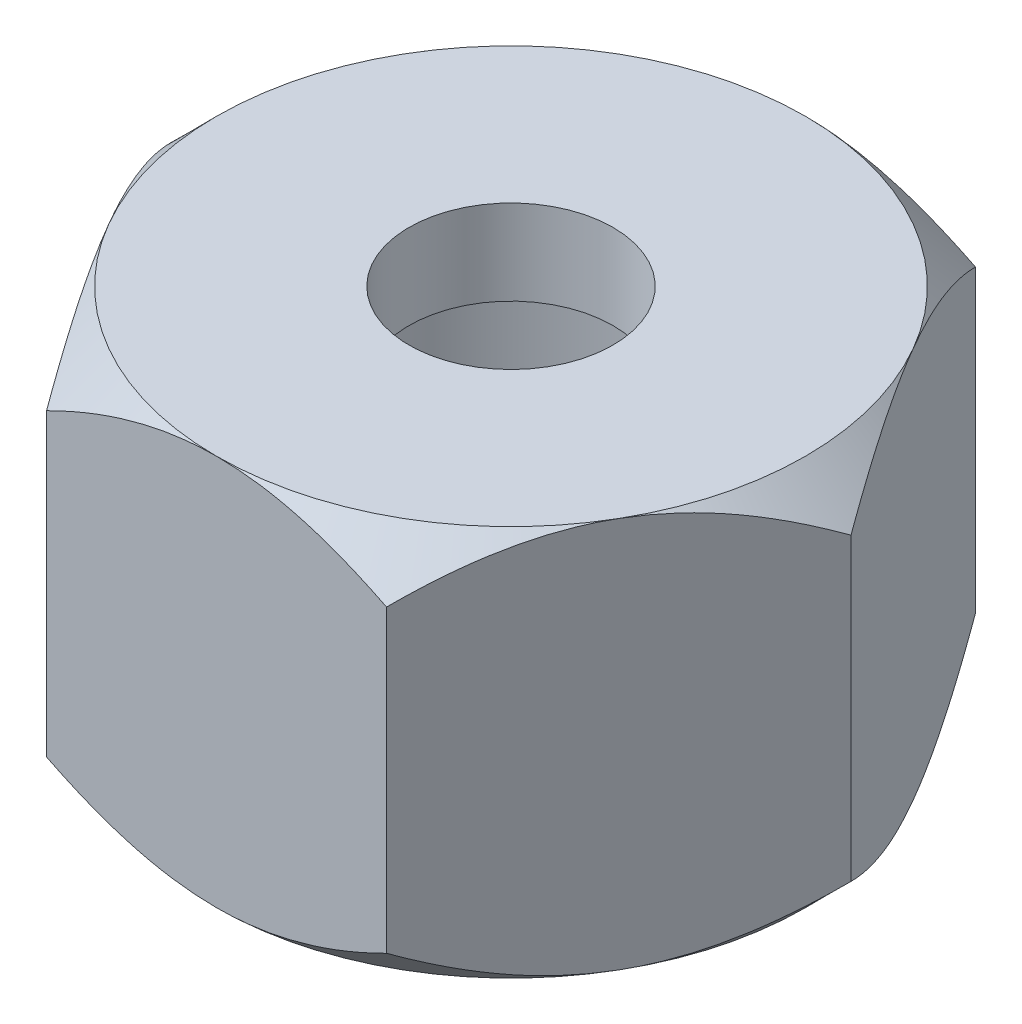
ISO-10303-21;
HEADER;
FILE_DESCRIPTION(('STEP AP214'),'2;1');
FILE_NAME('part.step','',(''),(''),'','','');
FILE_SCHEMA(('AUTOMOTIVE_DESIGN { 1 0 10303 214 1 1 1 1 }'));
ENDSEC;
DATA;
#1=APPLICATION_CONTEXT('core data for automotive mechanical design processes');
#2=APPLICATION_PROTOCOL_DEFINITION('international standard','automotive_design',2000,#1);
#3=PRODUCT_CONTEXT('',#1,'mechanical');
#4=PRODUCT('Part','Part','',(#3));
#5=PRODUCT_RELATED_PRODUCT_CATEGORY('part','',(#4));
#6=PRODUCT_DEFINITION_FORMATION('','',#4);
#7=PRODUCT_DEFINITION_CONTEXT('part definition',#1,'design');
#8=PRODUCT_DEFINITION('design','',#6,#7);
#9=PRODUCT_DEFINITION_SHAPE('','',#8);
#10=(LENGTH_UNIT() NAMED_UNIT(*) SI_UNIT(.MILLI.,.METRE.));
#11=(NAMED_UNIT(*) PLANE_ANGLE_UNIT() SI_UNIT($,.RADIAN.));
#12=(NAMED_UNIT(*) SI_UNIT($,.STERADIAN.) SOLID_ANGLE_UNIT());
#13=UNCERTAINTY_MEASURE_WITH_UNIT(LENGTH_MEASURE(1.E-05),#10,'distance_accuracy_value','');
#14=(GEOMETRIC_REPRESENTATION_CONTEXT(3) GLOBAL_UNCERTAINTY_ASSIGNED_CONTEXT((#13)) GLOBAL_UNIT_ASSIGNED_CONTEXT((#10,
#11,#12)) REPRESENTATION_CONTEXT('',''));
#15=CARTESIAN_POINT('',(0.,0.,0.));
#16=DIRECTION('',(0.,0.,1.));
#17=DIRECTION('',(1.,0.,0.));
#18=AXIS2_PLACEMENT_3D('',#15,#16,#17);
#19=CARTESIAN_POINT('',(0.,-11.5,0.));
#20=DIRECTION('',(0.,1.,0.));
#21=DIRECTION('',(0.,0.,1.));
#22=AXIS2_PLACEMENT_3D('',#19,#20,#21);
#23=PLANE('',#22);
#24=CARTESIAN_POINT('',(0.,-11.5,0.));
#25=DIRECTION('',(0.,1.,0.));
#26=DIRECTION('',(0.,0.,1.));
#27=AXIS2_PLACEMENT_3D('',#24,#25,#26);
#28=CIRCLE('',#27,17.3205080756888);
#29=CARTESIAN_POINT('',(-15.,-11.5,8.66025403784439));
#30=VERTEX_POINT('',#29);
#31=CARTESIAN_POINT('',(0.,-11.5,17.3205080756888));
#32=VERTEX_POINT('',#31);
#33=EDGE_CURVE('E442',#30,#32,#28,.T.);
#34=ORIENTED_EDGE('',*,*,#33,.F.);
#35=CARTESIAN_POINT('',(0.,-11.5,0.));
#36=DIRECTION('',(0.,1.,0.));
#37=DIRECTION('',(0.,0.,1.));
#38=AXIS2_PLACEMENT_3D('',#35,#36,#37);
#39=CIRCLE('',#38,17.3205080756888);
#40=CARTESIAN_POINT('',(-15.,-11.5,-8.66025403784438));
#41=VERTEX_POINT('',#40);
#42=EDGE_CURVE('E445',#41,#30,#39,.T.);
#43=ORIENTED_EDGE('',*,*,#42,.F.);
#44=CARTESIAN_POINT('',(0.,-11.5,0.));
#45=DIRECTION('',(0.,1.,0.));
#46=DIRECTION('',(0.,0.,1.));
#47=AXIS2_PLACEMENT_3D('',#44,#45,#46);
#48=CIRCLE('',#47,17.3205080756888);
#49=CARTESIAN_POINT('',(0.,-11.5,-17.3205080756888));
#50=VERTEX_POINT('',#49);
#51=EDGE_CURVE('E439',#50,#41,#48,.T.);
#52=ORIENTED_EDGE('',*,*,#51,.F.);
#53=CARTESIAN_POINT('',(0.,-11.5,0.));
#54=DIRECTION('',(0.,1.,0.));
#55=DIRECTION('',(0.,0.,1.));
#56=AXIS2_PLACEMENT_3D('',#53,#54,#55);
#57=CIRCLE('',#56,17.3205080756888);
#58=CARTESIAN_POINT('',(15.,-11.5,-8.66025403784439));
#59=VERTEX_POINT('',#58);
#60=EDGE_CURVE('E109',#59,#50,#57,.T.);
#61=ORIENTED_EDGE('',*,*,#60,.F.);
#62=CARTESIAN_POINT('',(0.,-11.5,0.));
#63=DIRECTION('',(0.,1.,0.));
#64=DIRECTION('',(0.,0.,1.));
#65=AXIS2_PLACEMENT_3D('',#62,#63,#64);
#66=CIRCLE('',#65,17.3205080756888);
#67=CARTESIAN_POINT('',(15.,-11.5,8.66025403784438));
#68=VERTEX_POINT('',#67);
#69=EDGE_CURVE('E105',#68,#59,#66,.T.);
#70=ORIENTED_EDGE('',*,*,#69,.F.);
#71=CARTESIAN_POINT('',(0.,-11.5,0.));
#72=DIRECTION('',(0.,1.,0.));
#73=DIRECTION('',(0.,0.,1.));
#74=AXIS2_PLACEMENT_3D('',#71,#72,#73);
#75=CIRCLE('',#74,17.3205080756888);
#76=EDGE_CURVE('E102',#32,#68,#75,.T.);
#77=ORIENTED_EDGE('',*,*,#76,.F.);
#78=EDGE_LOOP('',(#34,#43,#52,#61,#70,#77));
#79=FACE_BOUND('',#78,.T.);
#80=CARTESIAN_POINT('',(0.,-11.5,0.));
#81=DIRECTION('',(0.,-1.,0.));
#82=DIRECTION('',(0.,0.,-1.));
#83=AXIS2_PLACEMENT_3D('',#80,#81,#82);
#84=CIRCLE('',#83,12.25);
#85=CARTESIAN_POINT('',(0.,-11.5,-12.25));
#86=VERTEX_POINT('',#85);
#87=EDGE_CURVE('E19',#86,#86,#84,.F.);
#88=ORIENTED_EDGE('',*,*,#87,.T.);
#89=EDGE_LOOP('',(#88));
#90=FACE_BOUND('',#89,.T.);
#91=ADVANCED_FACE('F16',(#79,#90),#23,.F.);
#92=CARTESIAN_POINT('',(0.,-11.5,0.));
#93=DIRECTION('',(0.,-1.,0.));
#94=DIRECTION('',(0.,0.,-1.));
#95=AXIS2_PLACEMENT_3D('',#92,#93,#94);
#96=CYLINDRICAL_SURFACE('',#95,12.25);
#97=ORIENTED_EDGE('',*,*,#87,.F.);
#98=EDGE_LOOP('',(#97));
#99=FACE_BOUND('',#98,.T.);
#100=CARTESIAN_POINT('',(0.,6.5,0.));
#101=DIRECTION('',(0.,-1.,0.));
#102=DIRECTION('',(0.,0.,-1.));
#103=AXIS2_PLACEMENT_3D('',#100,#101,#102);
#104=CIRCLE('',#103,12.25);
#105=CARTESIAN_POINT('',(0.,6.5,-12.25));
#106=VERTEX_POINT('',#105);
#107=EDGE_CURVE('E169',#106,#106,#104,.T.);
#108=ORIENTED_EDGE('',*,*,#107,.F.);
#109=EDGE_LOOP('',(#108));
#110=FACE_BOUND('',#109,.T.);
#111=ADVANCED_FACE('F160',(#99,#110),#96,.F.);
#112=CARTESIAN_POINT('',(0.,-8.80443112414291,0.));
#113=DIRECTION('',(0.,1.,0.));
#114=DIRECTION('',(0.,0.,1.));
#115=AXIS2_PLACEMENT_3D('',#112,#113,#114);
#116=CONICAL_SURFACE('',#115,20.0160769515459,0.785398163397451);
#117=CARTESIAN_POINT('',(15.,-11.5,8.66025403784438));
#118=CARTESIAN_POINT('',(14.8669975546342,-11.5000308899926,8.89062103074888));
#119=CARTESIAN_POINT('',(14.734000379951,-11.4938729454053,9.1209788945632));
#120=CARTESIAN_POINT('',(14.4683058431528,-11.4694088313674,9.5811753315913));
#121=CARTESIAN_POINT('',(14.3356084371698,-11.4511045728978,9.81101398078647));
#122=CARTESIAN_POINT('',(14.070993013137,-11.4026197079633,10.2693413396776));
#123=CARTESIAN_POINT('',(13.9390740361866,-11.37245999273,10.4978317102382));
#124=CARTESIAN_POINT('',(13.6760220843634,-11.300698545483,10.9534510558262));
#125=CARTESIAN_POINT('',(13.5448891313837,-11.2590964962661,11.1805799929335));
#126=CARTESIAN_POINT('',(13.1569415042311,-11.1193346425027,11.8525249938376));
#127=CARTESIAN_POINT('',(12.9015141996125,-11.0054413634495,12.2949380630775));
#128=CARTESIAN_POINT('',(12.3955553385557,-10.7403074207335,13.1712845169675));
#129=CARTESIAN_POINT('',(12.1450253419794,-10.5890550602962,13.6052151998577));
#130=CARTESIAN_POINT('',(11.7352853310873,-10.3126594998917,14.3149057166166));
#131=CARTESIAN_POINT('',(11.5745127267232,-10.1966297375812,14.5933720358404));
#132=CARTESIAN_POINT('',(11.2553240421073,-9.95245444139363,15.1462230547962));
#133=CARTESIAN_POINT('',(11.0969074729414,-9.82431146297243,15.4206086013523));
#134=CARTESIAN_POINT('',(10.7807435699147,-9.55588660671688,15.9682205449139));
#135=CARTESIAN_POINT('',(10.6230200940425,-9.41549291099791,16.2414056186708));
#136=CARTESIAN_POINT('',(10.3098372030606,-9.12498223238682,16.7838542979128));
#137=CARTESIAN_POINT('',(10.1543776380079,-8.97486589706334,17.0531181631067));
#138=CARTESIAN_POINT('',(10.,-8.82050807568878,17.3205080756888));
#139=B_SPLINE_CURVE_WITH_KNOTS('',3,(#117,#118,#119,#120,#121,#122,#123,#124,#125,#126,#127,
#128,#129,#130,#131,#132,#133,#134,#135,#136,#137,#138),.UNSPECIFIED.,.F.,.F.,(4,2,2,2,2,2,2,2,
2,2,4),(0.,0.797925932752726,1.59572635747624,2.39212718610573,3.18855009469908,
4.75698092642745,6.32590344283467,7.35118308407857,8.37624690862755,9.41191012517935,
10.447504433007),.UNSPECIFIED.);
#140=CARTESIAN_POINT('',(10.,-8.82050807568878,17.3205080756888));
#141=VERTEX_POINT('',#140);
#142=EDGE_CURVE('E121',#68,#141,#139,.T.);
#143=ORIENTED_EDGE('',*,*,#142,.T.);
#144=CARTESIAN_POINT('',(10.,-8.82050807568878,17.3205080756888));
#145=CARTESIAN_POINT('',(9.65396064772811,-8.99349737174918,17.3205080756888));
#146=CARTESIAN_POINT('',(9.30519329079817,-9.16117486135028,17.3205080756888));
#147=CARTESIAN_POINT('',(8.60176516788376,-9.48421126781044,17.3205080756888));
#148=CARTESIAN_POINT('',(8.24710109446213,-9.63956296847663,17.3205080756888));
#149=CARTESIAN_POINT('',(7.52960372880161,-9.93697614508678,17.3205080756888));
#150=CARTESIAN_POINT('',(7.16673318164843,-10.0789482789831,17.3205080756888));
#151=CARTESIAN_POINT('',(6.43500272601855,-10.3463827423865,17.3205080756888));
#152=CARTESIAN_POINT('',(6.06614393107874,-10.471848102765,17.3205080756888));
#153=CARTESIAN_POINT('',(5.3332690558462,-10.7007363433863,17.3205080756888));
#154=CARTESIAN_POINT('',(4.96941966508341,-10.8046901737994,17.3205080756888));
#155=CARTESIAN_POINT('',(4.23666744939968,-10.9928880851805,17.3205080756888));
#156=CARTESIAN_POINT('',(3.86776522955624,-11.077134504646,17.3205080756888));
#157=CARTESIAN_POINT('',(3.12666552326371,-11.2237902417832,17.3205080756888));
#158=CARTESIAN_POINT('',(2.75447968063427,-11.2862581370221,17.3205080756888));
#159=CARTESIAN_POINT('',(2.00703036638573,-11.3880312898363,17.3205080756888));
#160=CARTESIAN_POINT('',(1.63176812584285,-11.4273453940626,17.3205080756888));
#161=CARTESIAN_POINT('',(1.15144881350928,-11.4620810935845,17.3205080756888));
#162=CARTESIAN_POINT('',(1.04713184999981,-11.4686892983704,17.3205080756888));
#163=CARTESIAN_POINT('',(0.838389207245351,-11.4800339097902,17.3205080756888));
#164=CARTESIAN_POINT('',(0.733963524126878,-11.484770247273,17.3205080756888));
#165=CARTESIAN_POINT('',(0.524630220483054,-11.4923733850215,17.3205080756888));
#166=CARTESIAN_POINT('',(0.419722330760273,-11.4952326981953,17.3205080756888));
#167=CARTESIAN_POINT('',(0.209876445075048,-11.4990463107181,17.3205080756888));
#168=CARTESIAN_POINT('',(0.104938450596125,-11.500000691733,17.3205080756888));
#169=CARTESIAN_POINT('',(0.,-11.5,17.3205080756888));
#170=B_SPLINE_CURVE_WITH_KNOTS('',3,(#144,#145,#146,#147,#148,#149,#150,#151,#152,#153,#154,
#155,#156,#157,#158,#159,#160,#161,#162,#163,#164,#165,#166,#167,#168,#169),.UNSPECIFIED.,.F.,
.F.,(4,2,2,2,2,2,2,2,2,2,2,2,4),(0.,1.1606612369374,2.32199705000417,3.49060719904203,
4.65900247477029,5.79373276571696,6.92832834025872,8.05984821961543,9.19093548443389,
9.50450420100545,9.81808450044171,10.1329081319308,10.4477182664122),.UNSPECIFIED.);
#171=EDGE_CURVE('E127',#141,#32,#170,.T.);
#172=ORIENTED_EDGE('',*,*,#171,.T.);
#173=ORIENTED_EDGE('',*,*,#76,.T.);
#174=EDGE_LOOP('',(#143,#172,#173));
#175=FACE_BOUND('',#174,.T.);
#176=ADVANCED_FACE('F125',(#175),#116,.T.);
#177=CARTESIAN_POINT('',(0.,-8.80443112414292,0.));
#178=DIRECTION('',(0.,1.,0.));
#179=DIRECTION('',(0.,0.,1.));
#180=AXIS2_PLACEMENT_3D('',#177,#178,#179);
#181=CONICAL_SURFACE('',#180,20.0160769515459,0.78539816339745);
#182=CARTESIAN_POINT('',(15.,-11.5,-8.66025403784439));
#183=CARTESIAN_POINT('',(15.1330024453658,-11.5000308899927,-8.42988704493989));
#184=CARTESIAN_POINT('',(15.265999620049,-11.4938729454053,-8.19952918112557));
#185=CARTESIAN_POINT('',(15.5316941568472,-11.4694088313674,-7.73933274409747));
#186=CARTESIAN_POINT('',(15.6643915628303,-11.4511045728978,-7.5094940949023));
#187=CARTESIAN_POINT('',(15.929006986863,-11.4026197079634,-7.05116673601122));
#188=CARTESIAN_POINT('',(16.0609259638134,-11.37245999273,-6.82267636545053));
#189=CARTESIAN_POINT('',(16.3239779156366,-11.300698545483,-6.3670570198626));
#190=CARTESIAN_POINT('',(16.4551108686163,-11.2590964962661,-6.13992808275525));
#191=CARTESIAN_POINT('',(16.8430584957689,-11.1193346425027,-5.46798308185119));
#192=CARTESIAN_POINT('',(17.0984858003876,-11.0054413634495,-5.02557001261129));
#193=CARTESIAN_POINT('',(17.6044446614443,-10.7403074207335,-4.14922355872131));
#194=CARTESIAN_POINT('',(17.8549746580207,-10.5890550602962,-3.71529287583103));
#195=CARTESIAN_POINT('',(18.2647146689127,-10.3126594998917,-3.00560235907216));
#196=CARTESIAN_POINT('',(18.4254872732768,-10.1966297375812,-2.72713603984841));
#197=CARTESIAN_POINT('',(18.7446759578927,-9.95245444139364,-2.17428502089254));
#198=CARTESIAN_POINT('',(18.9030925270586,-9.82431146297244,-1.89989947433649));
#199=CARTESIAN_POINT('',(19.2192564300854,-9.55588660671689,-1.35228753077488));
#200=CARTESIAN_POINT('',(19.3769799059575,-9.41549291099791,-1.07910245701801));
#201=CARTESIAN_POINT('',(19.6901627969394,-9.12498223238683,-0.53665377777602));
#202=CARTESIAN_POINT('',(19.8456223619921,-8.97486589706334,-0.267389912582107));
#203=CARTESIAN_POINT('',(20.,-8.82050807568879,0.));
#204=B_SPLINE_CURVE_WITH_KNOTS('',3,(#182,#183,#184,#185,#186,#187,#188,#189,#190,#191,#192,
#193,#194,#195,#196,#197,#198,#199,#200,#201,#202,#203),.UNSPECIFIED.,.F.,.F.,(4,2,2,2,2,2,2,2,
2,2,4),(0.,0.797925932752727,1.59572635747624,2.39212718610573,3.18855009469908,
4.75698092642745,6.32590344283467,7.35118308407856,8.37624690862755,9.41191012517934,
10.447504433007),.UNSPECIFIED.);
#205=CARTESIAN_POINT('',(20.,-8.82050807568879,0.));
#206=VERTEX_POINT('',#205);
#207=EDGE_CURVE('E117',#59,#206,#204,.T.);
#208=ORIENTED_EDGE('',*,*,#207,.T.);
#209=CARTESIAN_POINT('',(20.,-8.82050807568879,0.));
#210=CARTESIAN_POINT('',(19.8269803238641,-8.99349737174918,0.299678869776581));
#211=CARTESIAN_POINT('',(19.6525966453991,-9.16117486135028,0.60172026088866));
#212=CARTESIAN_POINT('',(19.3008825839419,-9.48421126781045,1.21090688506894));
#213=CARTESIAN_POINT('',(19.1235505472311,-9.63956296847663,1.51805498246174));
#214=CARTESIAN_POINT('',(18.7648018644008,-9.93697614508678,2.13942592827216));
#215=CARTESIAN_POINT('',(18.5833665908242,-10.0789482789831,2.45368104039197));
#216=CARTESIAN_POINT('',(18.2175013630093,-10.3463827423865,3.08737820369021));
#217=CARTESIAN_POINT('',(18.0330719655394,-10.471848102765,3.4068192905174));
#218=CARTESIAN_POINT('',(17.6666345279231,-10.7007363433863,4.04150755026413));
#219=CARTESIAN_POINT('',(17.4847098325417,-10.8046901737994,4.3566103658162));
#220=CARTESIAN_POINT('',(17.1183337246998,-10.9928880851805,4.99119239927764));
#221=CARTESIAN_POINT('',(16.9338826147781,-11.077134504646,5.31067109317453));
#222=CARTESIAN_POINT('',(16.5633327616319,-11.2237902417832,5.95248226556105));
#223=CARTESIAN_POINT('',(16.3772398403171,-11.2862581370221,6.27480466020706));
#224=CARTESIAN_POINT('',(16.0035151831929,-11.3880312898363,6.92211475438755));
#225=CARTESIAN_POINT('',(15.8158840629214,-11.4273453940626,7.24710138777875));
#226=CARTESIAN_POINT('',(15.5757244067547,-11.4620810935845,7.66307011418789));
#227=CARTESIAN_POINT('',(15.5235659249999,-11.4686892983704,7.75341125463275));
#228=CARTESIAN_POINT('',(15.4191946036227,-11.4800339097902,7.93418768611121));
#229=CARTESIAN_POINT('',(15.3669817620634,-11.484770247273,8.02462298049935));
#230=CARTESIAN_POINT('',(15.2623151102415,-11.4923733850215,8.20591093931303));
#231=CARTESIAN_POINT('',(15.2098611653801,-11.4952326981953,8.29676383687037));
#232=CARTESIAN_POINT('',(15.1049382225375,-11.4990463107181,8.47849570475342));
#233=CARTESIAN_POINT('',(15.0524692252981,-11.5000006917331,8.56937467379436));
#234=CARTESIAN_POINT('',(15.,-11.5,8.66025403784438));
#235=B_SPLINE_CURVE_WITH_KNOTS('',3,(#209,#210,#211,#212,#213,#214,#215,#216,#217,#218,#219,
#220,#221,#222,#223,#224,#225,#226,#227,#228,#229,#230,#231,#232,#233,#234),.UNSPECIFIED.,.F.,
.F.,(4,2,2,2,2,2,2,2,2,2,2,2,4),(0.,1.1606612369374,2.32199705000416,3.49060719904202,
4.65900247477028,5.79373276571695,6.92832834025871,8.05984821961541,9.19093548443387,
9.50450420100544,9.81808450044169,10.1329081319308,10.4477182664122),.UNSPECIFIED.);
#236=EDGE_CURVE('E115',#206,#68,#235,.T.);
#237=ORIENTED_EDGE('',*,*,#236,.T.);
#238=ORIENTED_EDGE('',*,*,#69,.T.);
#239=EDGE_LOOP('',(#208,#237,#238));
#240=FACE_BOUND('',#239,.T.);
#241=ADVANCED_FACE('F116',(#240),#181,.T.);
#242=CARTESIAN_POINT('',(0.,-8.80443112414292,0.));
#243=DIRECTION('',(0.,1.,0.));
#244=DIRECTION('',(0.,0.,1.));
#245=AXIS2_PLACEMENT_3D('',#242,#243,#244);
#246=CONICAL_SURFACE('',#245,20.0160769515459,0.78539816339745);
#247=ORIENTED_EDGE('',*,*,#60,.T.);
#248=CARTESIAN_POINT('',(0.,-11.5,-17.3205080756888));
#249=CARTESIAN_POINT('',(0.266004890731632,-11.5000308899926,-17.3205080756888));
#250=CARTESIAN_POINT('',(0.531999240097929,-11.4938729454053,-17.3205080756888));
#251=CARTESIAN_POINT('',(1.06338831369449,-11.4694088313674,-17.3205080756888));
#252=CARTESIAN_POINT('',(1.32878312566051,-11.4511045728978,-17.3205080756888));
#253=CARTESIAN_POINT('',(1.85801397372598,-11.4026197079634,-17.3205080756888));
#254=CARTESIAN_POINT('',(2.12185192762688,-11.37245999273,-17.3205080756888));
#255=CARTESIAN_POINT('',(2.64795583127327,-11.300698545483,-17.3205080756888));
#256=CARTESIAN_POINT('',(2.91022173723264,-11.2590964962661,-17.3205080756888));
#257=CARTESIAN_POINT('',(3.6861169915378,-11.1193346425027,-17.3205080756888));
#258=CARTESIAN_POINT('',(4.19697160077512,-11.0054413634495,-17.3205080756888));
#259=CARTESIAN_POINT('',(5.20888932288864,-10.7403074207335,-17.3205080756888));
#260=CARTESIAN_POINT('',(5.70994931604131,-10.5890550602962,-17.3205080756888));
#261=CARTESIAN_POINT('',(6.52942933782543,-10.3126594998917,-17.3205080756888));
#262=CARTESIAN_POINT('',(6.85097454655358,-10.1966297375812,-17.3205080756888));
#263=CARTESIAN_POINT('',(7.48935191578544,-9.95245444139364,-17.3205080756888));
#264=CARTESIAN_POINT('',(7.8061850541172,-9.82431146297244,-17.3205080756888));
#265=CARTESIAN_POINT('',(8.43851286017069,-9.55588660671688,-17.3205080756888));
#266=CARTESIAN_POINT('',(8.75395981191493,-9.41549291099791,-17.3205080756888));
#267=CARTESIAN_POINT('',(9.38032559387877,-9.12498223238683,-17.3205080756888));
#268=CARTESIAN_POINT('',(9.69124472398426,-8.97486589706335,-17.3205080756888));
#269=CARTESIAN_POINT('',(9.99999999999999,-8.82050807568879,-17.3205080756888));
#270=B_SPLINE_CURVE_WITH_KNOTS('',3,(#248,#249,#250,#251,#252,#253,#254,#255,#256,#257,#258,
#259,#260,#261,#262,#263,#264,#265,#266,#267,#268,#269),.UNSPECIFIED.,.F.,.F.,(4,2,2,2,2,2,2,2,
2,2,4),(0.,0.797925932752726,1.59572635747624,2.39212718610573,3.18855009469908,
4.75698092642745,6.32590344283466,7.35118308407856,8.37624690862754,9.41191012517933,
10.447504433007),.UNSPECIFIED.);
#271=CARTESIAN_POINT('',(9.99999999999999,-8.82050807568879,-17.3205080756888));
#272=VERTEX_POINT('',#271);
#273=EDGE_CURVE('E279',#50,#272,#270,.T.);
#274=ORIENTED_EDGE('',*,*,#273,.T.);
#275=CARTESIAN_POINT('',(10.,-8.82050807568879,-17.3205080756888));
#276=CARTESIAN_POINT('',(10.1730196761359,-8.99349737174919,-17.0208292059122));
#277=CARTESIAN_POINT('',(10.3474033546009,-9.16117486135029,-16.7187878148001));
#278=CARTESIAN_POINT('',(10.6991174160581,-9.48421126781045,-16.1096011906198));
#279=CARTESIAN_POINT('',(10.8764494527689,-9.63956296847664,-15.802453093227));
#280=CARTESIAN_POINT('',(11.2351981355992,-9.93697614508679,-15.1810821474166));
#281=CARTESIAN_POINT('',(11.4166334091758,-10.0789482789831,-14.8668270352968));
#282=CARTESIAN_POINT('',(11.7824986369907,-10.3463827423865,-14.2331298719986));
#283=CARTESIAN_POINT('',(11.9669280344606,-10.471848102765,-13.9136887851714));
#284=CARTESIAN_POINT('',(12.3333654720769,-10.7007363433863,-13.2790005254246));
#285=CARTESIAN_POINT('',(12.5152901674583,-10.8046901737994,-12.9638977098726));
#286=CARTESIAN_POINT('',(12.8816662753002,-10.9928880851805,-12.3293156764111));
#287=CARTESIAN_POINT('',(13.0661173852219,-11.077134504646,-12.0098369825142));
#288=CARTESIAN_POINT('',(13.4366672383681,-11.2237902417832,-11.3680258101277));
#289=CARTESIAN_POINT('',(13.6227601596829,-11.2862581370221,-11.0457034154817));
#290=CARTESIAN_POINT('',(13.9964848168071,-11.3880312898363,-10.3983933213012));
#291=CARTESIAN_POINT('',(14.1841159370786,-11.4273453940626,-10.07340668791));
#292=CARTESIAN_POINT('',(14.4242755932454,-11.4620810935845,-9.65743796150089));
#293=CARTESIAN_POINT('',(14.4764340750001,-11.4686892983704,-9.56709682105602));
#294=CARTESIAN_POINT('',(14.5808053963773,-11.4800339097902,-9.38632038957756));
#295=CARTESIAN_POINT('',(14.6330182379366,-11.484770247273,-9.29588509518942));
#296=CARTESIAN_POINT('',(14.7376848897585,-11.4923733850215,-9.11459713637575));
#297=CARTESIAN_POINT('',(14.7901388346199,-11.4952326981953,-9.0237442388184));
#298=CARTESIAN_POINT('',(14.8950617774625,-11.4990463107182,-8.84201237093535));
#299=CARTESIAN_POINT('',(14.9475307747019,-11.5000006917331,-8.75113340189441));
#300=CARTESIAN_POINT('',(15.,-11.5,-8.66025403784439));
#301=B_SPLINE_CURVE_WITH_KNOTS('',3,(#275,#276,#277,#278,#279,#280,#281,#282,#283,#284,#285,
#286,#287,#288,#289,#290,#291,#292,#293,#294,#295,#296,#297,#298,#299,#300),.UNSPECIFIED.,.F.,
.F.,(4,2,2,2,2,2,2,2,2,2,2,2,4),(0.,1.1606612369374,2.32199705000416,3.49060719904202,
4.65900247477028,5.79373276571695,6.92832834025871,8.05984821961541,9.19093548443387,
9.50450420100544,9.81808450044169,10.1329081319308,10.4477182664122),.UNSPECIFIED.);
#302=EDGE_CURVE('E134',#272,#59,#301,.T.);
#303=ORIENTED_EDGE('',*,*,#302,.T.);
#304=EDGE_LOOP('',(#247,#274,#303));
#305=FACE_BOUND('',#304,.T.);
#306=ADVANCED_FACE('F292',(#305),#246,.T.);
#307=CARTESIAN_POINT('',(0.,-8.80443112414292,0.));
#308=DIRECTION('',(0.,1.,0.));
#309=DIRECTION('',(0.,0.,1.));
#310=AXIS2_PLACEMENT_3D('',#307,#308,#309);
#311=CONICAL_SURFACE('',#310,20.0160769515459,0.785398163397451);
#312=CARTESIAN_POINT('',(-15.,-11.5,-8.66025403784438));
#313=CARTESIAN_POINT('',(-14.8669975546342,-11.5000308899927,-8.89062103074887));
#314=CARTESIAN_POINT('',(-14.734000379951,-11.4938729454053,-9.1209788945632));
#315=CARTESIAN_POINT('',(-14.4683058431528,-11.4694088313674,-9.5811753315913));
#316=CARTESIAN_POINT('',(-14.3356084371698,-11.4511045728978,-9.81101398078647));
#317=CARTESIAN_POINT('',(-14.070993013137,-11.4026197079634,-10.2693413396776));
#318=CARTESIAN_POINT('',(-13.9390740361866,-11.3724599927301,-10.4978317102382));
#319=CARTESIAN_POINT('',(-13.6760220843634,-11.300698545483,-10.9534510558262));
#320=CARTESIAN_POINT('',(-13.5448891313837,-11.2590964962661,-11.1805799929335));
#321=CARTESIAN_POINT('',(-13.1569415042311,-11.1193346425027,-11.8525249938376));
#322=CARTESIAN_POINT('',(-12.9015141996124,-11.0054413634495,-12.2949380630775));
#323=CARTESIAN_POINT('',(-12.3955553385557,-10.7403074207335,-13.1712845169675));
#324=CARTESIAN_POINT('',(-12.1450253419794,-10.5890550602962,-13.6052151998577));
#325=CARTESIAN_POINT('',(-11.7352853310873,-10.3126594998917,-14.3149057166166));
#326=CARTESIAN_POINT('',(-11.5745127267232,-10.1966297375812,-14.5933720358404));
#327=CARTESIAN_POINT('',(-11.2553240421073,-9.95245444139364,-15.1462230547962));
#328=CARTESIAN_POINT('',(-11.0969074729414,-9.82431146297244,-15.4206086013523));
#329=CARTESIAN_POINT('',(-10.7807435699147,-9.55588660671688,-15.9682205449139));
#330=CARTESIAN_POINT('',(-10.6230200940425,-9.41549291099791,-16.2414056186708));
#331=CARTESIAN_POINT('',(-10.3098372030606,-9.12498223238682,-16.7838542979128));
#332=CARTESIAN_POINT('',(-10.1543776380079,-8.97486589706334,-17.0531181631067));
#333=CARTESIAN_POINT('',(-10.,-8.82050807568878,-17.3205080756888));
#334=B_SPLINE_CURVE_WITH_KNOTS('',3,(#312,#313,#314,#315,#316,#317,#318,#319,#320,#321,#322,
#323,#324,#325,#326,#327,#328,#329,#330,#331,#332,#333),.UNSPECIFIED.,.F.,.F.,(4,2,2,2,2,2,2,2,
2,2,4),(0.,0.797925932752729,1.59572635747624,2.39212718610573,3.18855009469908,
4.75698092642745,6.32590344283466,7.35118308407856,8.37624690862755,9.41191012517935,
10.447504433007),.UNSPECIFIED.);
#335=CARTESIAN_POINT('',(-10.,-8.82050807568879,-17.3205080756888));
#336=VERTEX_POINT('',#335);
#337=EDGE_CURVE('E273',#41,#336,#334,.T.);
#338=ORIENTED_EDGE('',*,*,#337,.T.);
#339=CARTESIAN_POINT('',(-10.,-8.82050807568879,-17.3205080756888));
#340=CARTESIAN_POINT('',(-9.6539606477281,-8.99349737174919,-17.3205080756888));
#341=CARTESIAN_POINT('',(-9.30519329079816,-9.16117486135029,-17.3205080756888));
#342=CARTESIAN_POINT('',(-8.60176516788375,-9.48421126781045,-17.3205080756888));
#343=CARTESIAN_POINT('',(-8.24710109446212,-9.63956296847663,-17.3205080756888));
#344=CARTESIAN_POINT('',(-7.5296037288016,-9.93697614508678,-17.3205080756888));
#345=CARTESIAN_POINT('',(-7.16673318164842,-10.0789482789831,-17.3205080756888));
#346=CARTESIAN_POINT('',(-6.43500272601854,-10.3463827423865,-17.3205080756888));
#347=CARTESIAN_POINT('',(-6.06614393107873,-10.471848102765,-17.3205080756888));
#348=CARTESIAN_POINT('',(-5.33326905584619,-10.7007363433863,-17.3205080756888));
#349=CARTESIAN_POINT('',(-4.96941966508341,-10.8046901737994,-17.3205080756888));
#350=CARTESIAN_POINT('',(-4.23666744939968,-10.9928880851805,-17.3205080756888));
#351=CARTESIAN_POINT('',(-3.86776522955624,-11.077134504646,-17.3205080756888));
#352=CARTESIAN_POINT('',(-3.12666552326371,-11.2237902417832,-17.3205080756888));
#353=CARTESIAN_POINT('',(-2.75447968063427,-11.2862581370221,-17.3205080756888));
#354=CARTESIAN_POINT('',(-2.00703036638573,-11.3880312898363,-17.3205080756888));
#355=CARTESIAN_POINT('',(-1.63176812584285,-11.4273453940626,-17.3205080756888));
#356=CARTESIAN_POINT('',(-1.15144881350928,-11.4620810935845,-17.3205080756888));
#357=CARTESIAN_POINT('',(-1.04713184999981,-11.4686892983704,-17.3205080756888));
#358=CARTESIAN_POINT('',(-0.838389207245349,-11.4800339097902,-17.3205080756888));
#359=CARTESIAN_POINT('',(-0.733963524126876,-11.484770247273,-17.3205080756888));
#360=CARTESIAN_POINT('',(-0.524630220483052,-11.4923733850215,-17.3205080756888));
#361=CARTESIAN_POINT('',(-0.419722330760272,-11.4952326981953,-17.3205080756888));
#362=CARTESIAN_POINT('',(-0.209876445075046,-11.4990463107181,-17.3205080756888));
#363=CARTESIAN_POINT('',(-0.104938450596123,-11.5000006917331,-17.3205080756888));
#364=CARTESIAN_POINT('',(0.,-11.5,-17.3205080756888));
#365=B_SPLINE_CURVE_WITH_KNOTS('',3,(#339,#340,#341,#342,#343,#344,#345,#346,#347,#348,#349,
#350,#351,#352,#353,#354,#355,#356,#357,#358,#359,#360,#361,#362,#363,#364),.UNSPECIFIED.,.F.,
.F.,(4,2,2,2,2,2,2,2,2,2,2,2,4),(0.,1.1606612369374,2.32199705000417,3.49060719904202,
4.65900247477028,5.79373276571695,6.92832834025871,8.05984821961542,9.19093548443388,
9.50450420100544,9.8180845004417,10.1329081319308,10.4477182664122),.UNSPECIFIED.);
#366=EDGE_CURVE('E285',#336,#50,#365,.T.);
#367=ORIENTED_EDGE('',*,*,#366,.T.);
#368=ORIENTED_EDGE('',*,*,#51,.T.);
#369=EDGE_LOOP('',(#338,#367,#368));
#370=FACE_BOUND('',#369,.T.);
#371=ADVANCED_FACE('F295',(#370),#311,.T.);
#372=CARTESIAN_POINT('',(0.,-8.80443112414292,0.));
#373=DIRECTION('',(0.,1.,0.));
#374=DIRECTION('',(0.,0.,1.));
#375=AXIS2_PLACEMENT_3D('',#372,#373,#374);
#376=CONICAL_SURFACE('',#375,20.0160769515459,0.78539816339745);
#377=CARTESIAN_POINT('',(0.,-11.5,17.3205080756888));
#378=CARTESIAN_POINT('',(-0.26600489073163,-11.5000308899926,17.3205080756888));
#379=CARTESIAN_POINT('',(-0.531999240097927,-11.4938729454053,17.3205080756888));
#380=CARTESIAN_POINT('',(-1.06338831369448,-11.4694088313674,17.3205080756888));
#381=CARTESIAN_POINT('',(-1.3287831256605,-11.4511045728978,17.3205080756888));
#382=CARTESIAN_POINT('',(-1.85801397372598,-11.4026197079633,17.3205080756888));
#383=CARTESIAN_POINT('',(-2.12185192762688,-11.37245999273,17.3205080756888));
#384=CARTESIAN_POINT('',(-2.64795583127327,-11.300698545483,17.3205080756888));
#385=CARTESIAN_POINT('',(-2.91022173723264,-11.2590964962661,17.3205080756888));
#386=CARTESIAN_POINT('',(-3.6861169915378,-11.1193346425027,17.3205080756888));
#387=CARTESIAN_POINT('',(-4.19697160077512,-11.0054413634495,17.3205080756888));
#388=CARTESIAN_POINT('',(-5.20888932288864,-10.7403074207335,17.3205080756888));
#389=CARTESIAN_POINT('',(-5.70994931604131,-10.5890550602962,17.3205080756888));
#390=CARTESIAN_POINT('',(-6.52942933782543,-10.3126594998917,17.3205080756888));
#391=CARTESIAN_POINT('',(-6.85097454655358,-10.1966297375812,17.3205080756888));
#392=CARTESIAN_POINT('',(-7.48935191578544,-9.95245444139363,17.3205080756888));
#393=CARTESIAN_POINT('',(-7.80618505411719,-9.82431146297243,17.3205080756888));
#394=CARTESIAN_POINT('',(-8.43851286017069,-9.55588660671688,17.3205080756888));
#395=CARTESIAN_POINT('',(-8.75395981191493,-9.41549291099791,17.3205080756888));
#396=CARTESIAN_POINT('',(-9.38032559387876,-9.12498223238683,17.3205080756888));
#397=CARTESIAN_POINT('',(-9.69124472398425,-8.97486589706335,17.3205080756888));
#398=CARTESIAN_POINT('',(-9.99999999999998,-8.82050807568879,17.3205080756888));
#399=B_SPLINE_CURVE_WITH_KNOTS('',3,(#377,#378,#379,#380,#381,#382,#383,#384,#385,#386,#387,
#388,#389,#390,#391,#392,#393,#394,#395,#396,#397,#398),.UNSPECIFIED.,.F.,.F.,(4,2,2,2,2,2,2,2,
2,2,4),(0.,0.797925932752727,1.59572635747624,2.39212718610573,3.18855009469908,
4.75698092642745,6.32590344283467,7.35118308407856,8.37624690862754,9.41191012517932,
10.447504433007),.UNSPECIFIED.);
#400=CARTESIAN_POINT('',(-9.99999999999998,-8.82050807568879,17.3205080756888));
#401=VERTEX_POINT('',#400);
#402=EDGE_CURVE('E122',#32,#401,#399,.T.);
#403=ORIENTED_EDGE('',*,*,#402,.T.);
#404=CARTESIAN_POINT('',(-9.99999999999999,-8.82050807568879,17.3205080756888));
#405=CARTESIAN_POINT('',(-10.1730196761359,-8.99349737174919,17.0208292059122));
#406=CARTESIAN_POINT('',(-10.3474033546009,-9.16117486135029,16.7187878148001));
#407=CARTESIAN_POINT('',(-10.6991174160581,-9.48421126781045,16.1096011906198));
#408=CARTESIAN_POINT('',(-10.8764494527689,-9.63956296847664,15.802453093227));
#409=CARTESIAN_POINT('',(-11.2351981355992,-9.93697614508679,15.1810821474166));
#410=CARTESIAN_POINT('',(-11.4166334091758,-10.0789482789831,14.8668270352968));
#411=CARTESIAN_POINT('',(-11.7824986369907,-10.3463827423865,14.2331298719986));
#412=CARTESIAN_POINT('',(-11.9669280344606,-10.471848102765,13.9136887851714));
#413=CARTESIAN_POINT('',(-12.3333654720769,-10.7007363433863,13.2790005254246));
#414=CARTESIAN_POINT('',(-12.5152901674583,-10.8046901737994,12.9638977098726));
#415=CARTESIAN_POINT('',(-12.8816662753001,-10.9928880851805,12.3293156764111));
#416=CARTESIAN_POINT('',(-13.0661173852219,-11.077134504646,12.0098369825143));
#417=CARTESIAN_POINT('',(-13.4366672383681,-11.2237902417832,11.3680258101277));
#418=CARTESIAN_POINT('',(-13.6227601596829,-11.2862581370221,11.0457034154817));
#419=CARTESIAN_POINT('',(-13.9964848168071,-11.3880312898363,10.3983933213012));
#420=CARTESIAN_POINT('',(-14.1841159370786,-11.4273453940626,10.07340668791));
#421=CARTESIAN_POINT('',(-14.4242755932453,-11.4620810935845,9.65743796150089));
#422=CARTESIAN_POINT('',(-14.4764340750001,-11.4686892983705,9.56709682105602));
#423=CARTESIAN_POINT('',(-14.5808053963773,-11.4800339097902,9.38632038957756));
#424=CARTESIAN_POINT('',(-14.6330182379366,-11.484770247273,9.29588509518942));
#425=CARTESIAN_POINT('',(-14.7376848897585,-11.4923733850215,9.11459713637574));
#426=CARTESIAN_POINT('',(-14.7901388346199,-11.4952326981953,9.0237442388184));
#427=CARTESIAN_POINT('',(-14.8950617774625,-11.4990463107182,8.84201237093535));
#428=CARTESIAN_POINT('',(-14.9475307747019,-11.5000006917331,8.75113340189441));
#429=CARTESIAN_POINT('',(-15.,-11.5,8.66025403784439));
#430=B_SPLINE_CURVE_WITH_KNOTS('',3,(#404,#405,#406,#407,#408,#409,#410,#411,#412,#413,#414,
#415,#416,#417,#418,#419,#420,#421,#422,#423,#424,#425,#426,#427,#428,#429),.UNSPECIFIED.,.F.,
.F.,(4,2,2,2,2,2,2,2,2,2,2,2,4),(0.,1.1606612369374,2.32199705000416,3.49060719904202,
4.65900247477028,5.79373276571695,6.92832834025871,8.05984821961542,9.19093548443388,
9.50450420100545,9.8180845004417,10.1329081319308,10.4477182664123),.UNSPECIFIED.);
#431=EDGE_CURVE('E250',#401,#30,#430,.T.);
#432=ORIENTED_EDGE('',*,*,#431,.T.);
#433=ORIENTED_EDGE('',*,*,#33,.T.);
#434=EDGE_LOOP('',(#403,#432,#433));
#435=FACE_BOUND('',#434,.T.);
#436=ADVANCED_FACE('F260',(#435),#376,.T.);
#437=CARTESIAN_POINT('',(0.,-8.80443112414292,0.));
#438=DIRECTION('',(0.,1.,0.));
#439=DIRECTION('',(0.,0.,1.));
#440=AXIS2_PLACEMENT_3D('',#437,#438,#439);
#441=CONICAL_SURFACE('',#440,20.0160769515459,0.78539816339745);
#442=CARTESIAN_POINT('',(-15.,-11.5,8.66025403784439));
#443=CARTESIAN_POINT('',(-15.1330024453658,-11.5000308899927,8.42988704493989));
#444=CARTESIAN_POINT('',(-15.265999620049,-11.4938729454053,8.19952918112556));
#445=CARTESIAN_POINT('',(-15.5316941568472,-11.4694088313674,7.73933274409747));
#446=CARTESIAN_POINT('',(-15.6643915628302,-11.4511045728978,7.5094940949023));
#447=CARTESIAN_POINT('',(-15.929006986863,-11.4026197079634,7.05116673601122));
#448=CARTESIAN_POINT('',(-16.0609259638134,-11.3724599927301,6.82267636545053));
#449=CARTESIAN_POINT('',(-16.3239779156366,-11.300698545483,6.3670570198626));
#450=CARTESIAN_POINT('',(-16.4551108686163,-11.2590964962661,6.13992808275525));
#451=CARTESIAN_POINT('',(-16.8430584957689,-11.1193346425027,5.46798308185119));
#452=CARTESIAN_POINT('',(-17.0984858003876,-11.0054413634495,5.02557001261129));
#453=CARTESIAN_POINT('',(-17.6044446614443,-10.7403074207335,4.14922355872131));
#454=CARTESIAN_POINT('',(-17.8549746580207,-10.5890550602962,3.71529287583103));
#455=CARTESIAN_POINT('',(-18.2647146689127,-10.3126594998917,3.00560235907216));
#456=CARTESIAN_POINT('',(-18.4254872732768,-10.1966297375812,2.72713603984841));
#457=CARTESIAN_POINT('',(-18.7446759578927,-9.95245444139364,2.17428502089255));
#458=CARTESIAN_POINT('',(-18.9030925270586,-9.82431146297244,1.89989947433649));
#459=CARTESIAN_POINT('',(-19.2192564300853,-9.55588660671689,1.35228753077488));
#460=CARTESIAN_POINT('',(-19.3769799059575,-9.41549291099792,1.07910245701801));
#461=CARTESIAN_POINT('',(-19.6901627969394,-9.12498223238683,0.536653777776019));
#462=CARTESIAN_POINT('',(-19.8456223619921,-8.97486589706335,0.267389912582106));
#463=CARTESIAN_POINT('',(-20.,-8.82050807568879,0.));
#464=B_SPLINE_CURVE_WITH_KNOTS('',3,(#442,#443,#444,#445,#446,#447,#448,#449,#450,#451,#452,
#453,#454,#455,#456,#457,#458,#459,#460,#461,#462,#463),.UNSPECIFIED.,.F.,.F.,(4,2,2,2,2,2,2,2,
2,2,4),(0.,0.797925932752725,1.59572635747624,2.39212718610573,3.18855009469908,
4.75698092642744,6.32590344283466,7.35118308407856,8.37624690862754,9.41191012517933,
10.447504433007),.UNSPECIFIED.);
#465=CARTESIAN_POINT('',(-20.,-8.82050807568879,0.));
#466=VERTEX_POINT('',#465);
#467=EDGE_CURVE('E244',#30,#466,#464,.T.);
#468=ORIENTED_EDGE('',*,*,#467,.T.);
#469=CARTESIAN_POINT('',(-20.,-8.82050807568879,0.));
#470=CARTESIAN_POINT('',(-19.826980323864,-8.99349737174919,-0.299678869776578));
#471=CARTESIAN_POINT('',(-19.6525966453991,-9.16117486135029,-0.601720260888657));
#472=CARTESIAN_POINT('',(-19.3008825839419,-9.48421126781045,-1.21090688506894));
#473=CARTESIAN_POINT('',(-19.1235505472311,-9.63956296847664,-1.51805498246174));
#474=CARTESIAN_POINT('',(-18.7648018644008,-9.93697614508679,-2.13942592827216));
#475=CARTESIAN_POINT('',(-18.5833665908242,-10.0789482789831,-2.45368104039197));
#476=CARTESIAN_POINT('',(-18.2175013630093,-10.3463827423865,-3.08737820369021));
#477=CARTESIAN_POINT('',(-18.0330719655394,-10.471848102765,-3.4068192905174));
#478=CARTESIAN_POINT('',(-17.6666345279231,-10.7007363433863,-4.04150755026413));
#479=CARTESIAN_POINT('',(-17.4847098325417,-10.8046901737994,-4.35661036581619));
#480=CARTESIAN_POINT('',(-17.1183337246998,-10.9928880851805,-4.99119239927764));
#481=CARTESIAN_POINT('',(-16.9338826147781,-11.077134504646,-5.31067109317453));
#482=CARTESIAN_POINT('',(-16.5633327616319,-11.2237902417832,-5.95248226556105));
#483=CARTESIAN_POINT('',(-16.3772398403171,-11.2862581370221,-6.27480466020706));
#484=CARTESIAN_POINT('',(-16.0035151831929,-11.3880312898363,-6.92211475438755));
#485=CARTESIAN_POINT('',(-15.8158840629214,-11.4273453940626,-7.24710138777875));
#486=CARTESIAN_POINT('',(-15.5757244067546,-11.4620810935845,-7.66307011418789));
#487=CARTESIAN_POINT('',(-15.5235659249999,-11.4686892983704,-7.75341125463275));
#488=CARTESIAN_POINT('',(-15.4191946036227,-11.4800339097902,-7.93418768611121));
#489=CARTESIAN_POINT('',(-15.3669817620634,-11.484770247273,-8.02462298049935));
#490=CARTESIAN_POINT('',(-15.2623151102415,-11.4923733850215,-8.20591093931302));
#491=CARTESIAN_POINT('',(-15.2098611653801,-11.4952326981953,-8.29676383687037));
#492=CARTESIAN_POINT('',(-15.1049382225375,-11.4990463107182,-8.47849570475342));
#493=CARTESIAN_POINT('',(-15.0524692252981,-11.5000006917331,-8.56937467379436));
#494=CARTESIAN_POINT('',(-15.,-11.5,-8.66025403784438));
#495=B_SPLINE_CURVE_WITH_KNOTS('',3,(#469,#470,#471,#472,#473,#474,#475,#476,#477,#478,#479,
#480,#481,#482,#483,#484,#485,#486,#487,#488,#489,#490,#491,#492,#493,#494),.UNSPECIFIED.,.F.,
.F.,(4,2,2,2,2,2,2,2,2,2,2,2,4),(0.,1.1606612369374,2.32199705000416,3.49060719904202,
4.65900247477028,5.79373276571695,6.92832834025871,8.05984821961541,9.19093548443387,
9.50450420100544,9.81808450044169,10.1329081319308,10.4477182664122),.UNSPECIFIED.);
#496=EDGE_CURVE('E266',#466,#41,#495,.T.);
#497=ORIENTED_EDGE('',*,*,#496,.T.);
#498=ORIENTED_EDGE('',*,*,#42,.T.);
#499=EDGE_LOOP('',(#468,#497,#498));
#500=FACE_BOUND('',#499,.T.);
#501=ADVANCED_FACE('F257',(#500),#441,.T.);
#502=CARTESIAN_POINT('',(0.,6.5,0.));
#503=DIRECTION('',(0.,-1.,0.));
#504=DIRECTION('',(0.,0.,-1.));
#505=AXIS2_PLACEMENT_3D('',#502,#503,#504);
#506=PLANE('',#505);
#507=ORIENTED_EDGE('',*,*,#107,.T.);
#508=EDGE_LOOP('',(#507));
#509=FACE_BOUND('',#508,.T.);
#510=CARTESIAN_POINT('',(0.,6.5,0.));
#511=DIRECTION('',(0.,-1.,0.));
#512=DIRECTION('',(0.,0.,-1.));
#513=AXIS2_PLACEMENT_3D('',#510,#511,#512);
#514=CIRCLE('',#513,6.);
#515=CARTESIAN_POINT('',(0.,6.5,-6.));
#516=VERTEX_POINT('',#515);
#517=EDGE_CURVE('E251',#516,#516,#514,.F.);
#518=ORIENTED_EDGE('',*,*,#517,.T.);
#519=EDGE_LOOP('',(#518));
#520=FACE_BOUND('',#519,.T.);
#521=ADVANCED_FACE('F180',(#509,#520),#506,.T.);
#522=CARTESIAN_POINT('',(-9.99999999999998,11.5,17.3205080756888));
#523=DIRECTION('',(0.,0.,-1.));
#524=DIRECTION('',(-1.,0.,0.));
#525=AXIS2_PLACEMENT_3D('',#522,#523,#524);
#526=PLANE('',#525);
#527=ORIENTED_EDGE('',*,*,#402,.F.);
#528=ORIENTED_EDGE('',*,*,#171,.F.);
#529=DIRECTION('',(0.,1.,0.));
#530=VECTOR('',#529,1.);
#531=CARTESIAN_POINT('',(10.,11.5,17.3205080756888));
#532=LINE('',#531,#530);
#533=CARTESIAN_POINT('',(9.99999999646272,8.82050807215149,17.3205080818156));
#534=VERTEX_POINT('',#533);
#535=EDGE_CURVE('E132',#141,#534,#532,.T.);
#536=ORIENTED_EDGE('',*,*,#535,.T.);
#537=CARTESIAN_POINT('',(0.,11.5,17.3205080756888));
#538=CARTESIAN_POINT('',(0.266004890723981,11.5000308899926,17.3205080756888));
#539=CARTESIAN_POINT('',(0.531999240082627,11.4938729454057,17.3205080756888));
#540=CARTESIAN_POINT('',(1.06338831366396,11.4694088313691,17.3205080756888));
#541=CARTESIAN_POINT('',(1.32878312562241,11.4511045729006,17.3205080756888));
#542=CARTESIAN_POINT('',(1.85801397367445,11.4026197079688,17.3205080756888));
#543=CARTESIAN_POINT('',(2.12185192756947,11.3724599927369,17.3205080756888));
#544=CARTESIAN_POINT('',(2.6479558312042,11.3006985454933,17.3205080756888));
#545=CARTESIAN_POINT('',(2.91022173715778,11.2590964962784,17.3205080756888));
#546=CARTESIAN_POINT('',(3.6861169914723,11.1193346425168,17.3205080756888));
#547=CARTESIAN_POINT('',(4.19697160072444,11.0054413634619,17.3205080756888));
#548=CARTESIAN_POINT('',(5.20888932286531,10.7403074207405,17.3205080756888));
#549=CARTESIAN_POINT('',(5.70994931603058,10.5890550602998,17.3205080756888));
#550=CARTESIAN_POINT('',(6.52942933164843,10.3126595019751,17.3205080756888));
#551=CARTESIAN_POINT('',(6.85097453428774,10.1966297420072,17.3205080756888));
#552=CARTESIAN_POINT('',(7.4893518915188,9.95245445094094,17.3205080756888));
#553=CARTESIAN_POINT('',(7.80618502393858,9.82431147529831,17.3205080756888));
#554=CARTESIAN_POINT('',(8.43851281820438,9.55588662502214,17.3205080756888));
#555=CARTESIAN_POINT('',(8.75395976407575,9.41549293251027,17.3205080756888));
#556=CARTESIAN_POINT('',(9.38032553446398,9.12498226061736,17.3205080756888));
#557=CARTESIAN_POINT('',(9.69124465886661,8.97486592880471,17.3205080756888));
#558=CARTESIAN_POINT('',(9.99999992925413,8.82050811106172,17.3205080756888));
#559=B_SPLINE_CURVE_WITH_KNOTS('',3,(#537,#538,#539,#540,#541,#542,#543,#544,#545,#546,#547,
#548,#549,#550,#551,#552,#553,#554,#555,#556,#557,#558),.UNSPECIFIED.,.F.,.F.,(4,2,2,2,2,2,2,2,
2,2,4),(0.,0.797925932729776,1.59572635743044,2.39212718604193,3.18855009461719,
4.75698092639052,6.32590344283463,7.35118306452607,8.37624686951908,9.41191006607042,
10.4475043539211),.UNSPECIFIED.);
#560=CARTESIAN_POINT('',(0.,11.5,17.3205080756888));
#561=VERTEX_POINT('',#560);
#562=EDGE_CURVE('E186',#561,#534,#559,.T.);
#563=ORIENTED_EDGE('',*,*,#562,.F.);
#564=CARTESIAN_POINT('',(-10.0000000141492,8.8205080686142,17.3205080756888));
#565=CARTESIAN_POINT('',(-9.65396066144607,8.99349736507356,17.3205080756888));
#566=CARTESIAN_POINT('',(-9.30519330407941,9.16117485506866,17.3205080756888));
#567=CARTESIAN_POINT('',(-8.60176518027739,9.48421126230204,17.3205080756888));
#568=CARTESIAN_POINT('',(-8.24710110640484,9.63956296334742,17.3205080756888));
#569=CARTESIAN_POINT('',(-7.52960373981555,9.93697614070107,17.3205080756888));
#570=CARTESIAN_POINT('',(-7.16673319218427,10.0789482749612,17.3205080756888));
#571=CARTESIAN_POINT('',(-6.43500273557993,10.3463827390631,17.3205080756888));
#572=CARTESIAN_POINT('',(-6.06614394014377,10.4718480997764,17.3205080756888));
#573=CARTESIAN_POINT('',(-5.33326906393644,10.7007363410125,17.3205080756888));
#574=CARTESIAN_POINT('',(-4.96941967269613,10.804690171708,17.3205080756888));
#575=CARTESIAN_POINT('',(-4.2366674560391,10.9928880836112,17.3205080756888));
#576=CARTESIAN_POINT('',(-3.86776523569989,11.0771345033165,17.3205080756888));
#577=CARTESIAN_POINT('',(-3.12666552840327,11.2237902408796,17.3205080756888));
#578=CARTESIAN_POINT('',(-2.75447968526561,11.2862581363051,17.3205080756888));
#579=CARTESIAN_POINT('',(-2.00703036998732,11.3880312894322,17.3205080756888));
#580=CARTESIAN_POINT('',(-1.63176812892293,11.4273453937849,17.3205080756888));
#581=CARTESIAN_POINT('',(-1.15144881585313,11.4620810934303,17.3205080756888));
#582=CARTESIAN_POINT('',(-1.04713185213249,11.468689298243,17.3205080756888));
#583=CARTESIAN_POINT('',(-0.838389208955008,11.4800339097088,17.3205080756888));
#584=CARTESIAN_POINT('',(-0.73396352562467,11.4847702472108,17.3205080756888));
#585=CARTESIAN_POINT('',(-0.524630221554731,11.4923733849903,17.3205080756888));
#586=CARTESIAN_POINT('',(-0.419722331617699,11.4952326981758,17.3205080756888));
#587=CARTESIAN_POINT('',(-0.209876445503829,11.4990463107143,17.3205080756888));
#588=CARTESIAN_POINT('',(-0.104938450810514,11.5000006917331,17.3205080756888));
#589=CARTESIAN_POINT('',(0.,11.5,17.3205080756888));
#590=B_SPLINE_CURVE_WITH_KNOTS('',3,(#564,#565,#566,#567,#568,#569,#570,#571,#572,#573,#574,
#575,#576,#577,#578,#579,#580,#581,#582,#583,#584,#585,#586,#587,#588,#589),.UNSPECIFIED.,.F.,
.F.,(4,2,2,2,2,2,2,2,2,2,2,2,4),(0.,1.16066123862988,2.32199705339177,3.49060720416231,
4.65900248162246,5.79373277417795,6.92832835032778,8.05984823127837,9.19093549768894,
9.50450421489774,9.81808451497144,10.1329081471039,10.4477182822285),.UNSPECIFIED.);
#591=CARTESIAN_POINT('',(-10.0000000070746,8.8205080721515,17.3205080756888));
#592=VERTEX_POINT('',#591);
#593=EDGE_CURVE('E195',#592,#561,#590,.T.);
#594=ORIENTED_EDGE('',*,*,#593,.F.);
#595=DIRECTION('',(0.,1.,0.));
#596=VECTOR('',#595,1.);
#597=CARTESIAN_POINT('',(-9.99999999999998,11.5,17.3205080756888));
#598=LINE('',#597,#596);
#599=EDGE_CURVE('E407',#592,#401,#598,.F.);
#600=ORIENTED_EDGE('',*,*,#599,.T.);
#601=EDGE_LOOP('',(#527,#528,#536,#563,#594,#600));
#602=FACE_BOUND('',#601,.T.);
#603=ADVANCED_FACE('F176',(#602),#526,.F.);
#604=CARTESIAN_POINT('',(10.,11.5,17.3205080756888));
#605=DIRECTION('',(-0.866025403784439,0.,-0.5));
#606=DIRECTION('',(-0.5,0.,0.866025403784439));
#607=AXIS2_PLACEMENT_3D('',#604,#605,#606);
#608=PLANE('',#607);
#609=ORIENTED_EDGE('',*,*,#142,.F.);
#610=ORIENTED_EDGE('',*,*,#236,.F.);
#611=DIRECTION('',(0.,1.,0.));
#612=VECTOR('',#611,1.);
#613=CARTESIAN_POINT('',(20.,11.5,0.));
#614=LINE('',#613,#612);
#615=CARTESIAN_POINT('',(20.0000000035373,8.82050807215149,6.12676786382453E-09));
#616=VERTEX_POINT('',#615);
#617=EDGE_CURVE('E412',#206,#616,#614,.T.);
#618=ORIENTED_EDGE('',*,*,#617,.T.);
#619=CARTESIAN_POINT('',(15.,11.5,8.66025403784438));
#620=CARTESIAN_POINT('',(15.133002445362,11.5000308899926,8.42988704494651));
#621=CARTESIAN_POINT('',(15.2659996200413,11.4938729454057,8.19952918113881));
#622=CARTESIAN_POINT('',(15.531694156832,11.4694088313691,7.7393327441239));
#623=CARTESIAN_POINT('',(15.6643915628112,11.4511045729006,7.50949409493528));
#624=CARTESIAN_POINT('',(15.9290069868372,11.4026197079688,7.05116673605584));
#625=CARTESIAN_POINT('',(16.0609259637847,11.3724599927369,6.82267636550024));
#626=CARTESIAN_POINT('',(16.3239779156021,11.3006985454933,6.36705701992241));
#627=CARTESIAN_POINT('',(16.4551108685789,11.2590964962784,6.13992808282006));
#628=CARTESIAN_POINT('',(16.8430584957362,11.1193346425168,5.4679830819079));
#629=CARTESIAN_POINT('',(17.0984858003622,11.0054413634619,5.02557001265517));
#630=CARTESIAN_POINT('',(17.6044446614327,10.7403074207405,4.1492235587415));
#631=CARTESIAN_POINT('',(17.8549746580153,10.5890550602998,3.71529287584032));
#632=CARTESIAN_POINT('',(18.2647146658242,10.3126595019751,3.00560236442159));
#633=CARTESIAN_POINT('',(18.4254872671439,10.1966297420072,2.72713605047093));
#634=CARTESIAN_POINT('',(18.7446759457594,9.95245445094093,2.17428504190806));
#635=CARTESIAN_POINT('',(18.9030925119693,9.82431147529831,1.89989950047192));
#636=CARTESIAN_POINT('',(19.2192564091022,9.55588662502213,1.35228756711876));
#637=CARTESIAN_POINT('',(19.3769798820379,9.41549293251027,1.07910249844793));
#638=CARTESIAN_POINT('',(19.690162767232,9.12498226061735,0.536653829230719));
#639=CARTESIAN_POINT('',(19.8456223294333,8.97486592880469,0.267389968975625));
#640=CARTESIAN_POINT('',(19.9999999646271,8.82050811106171,6.12677011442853E-08));
#641=B_SPLINE_CURVE_WITH_KNOTS('',3,(#619,#620,#621,#622,#623,#624,#625,#626,#627,#628,#629,
#630,#631,#632,#633,#634,#635,#636,#637,#638,#639,#640),.UNSPECIFIED.,.F.,.F.,(4,2,2,2,2,2,2,2,
2,2,4),(0.,0.797925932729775,1.59572635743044,2.39212718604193,3.18855009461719,
4.75698092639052,6.32590344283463,7.35118306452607,8.3762468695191,9.41191006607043,
10.4475043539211),.UNSPECIFIED.);
#642=CARTESIAN_POINT('',(15.,11.5,8.66025403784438));
#643=VERTEX_POINT('',#642);
#644=EDGE_CURVE('E373',#643,#616,#641,.T.);
#645=ORIENTED_EDGE('',*,*,#644,.F.);
#646=CARTESIAN_POINT('',(9.99999996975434,8.8205080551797,17.3205080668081));
#647=CARTESIAN_POINT('',(10.1730196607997,8.99349736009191,17.0208292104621));
#648=CARTESIAN_POINT('',(10.3474033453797,9.1611748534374,16.7187878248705));
#649=CARTESIAN_POINT('',(10.6991174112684,9.48421126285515,16.1096012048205));
#650=CARTESIAN_POINT('',(10.8764494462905,9.63956296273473,15.8024531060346));
#651=CARTESIAN_POINT('',(11.2351981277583,9.93697613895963,15.1810821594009));
#652=CARTESIAN_POINT('',(11.4166334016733,10.0789482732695,14.8668270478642));
#653=CARTESIAN_POINT('',(11.7824986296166,10.3463827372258,14.2331298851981));
#654=CARTESIAN_POINT('',(11.9669280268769,10.4718480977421,13.9136887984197));
#655=CARTESIAN_POINT('',(12.333365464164,10.7007363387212,13.2790005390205));
#656=CARTESIAN_POINT('',(12.5152901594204,10.8046901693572,12.9638977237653));
#657=CARTESIAN_POINT('',(12.8816662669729,10.9928880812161,12.3293156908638));
#658=CARTESIAN_POINT('',(13.0661173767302,11.0771345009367,12.0098369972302));
#659=CARTESIAN_POINT('',(13.4366672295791,11.2237902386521,11.368025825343));
#660=CARTESIAN_POINT('',(13.6227601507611,11.2862581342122,11.0457034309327));
#661=CARTESIAN_POINT('',(13.9964848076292,11.3880312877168,10.3983933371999));
#662=CARTESIAN_POINT('',(14.1841159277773,11.4273453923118,10.0734067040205));
#663=CARTESIAN_POINT('',(14.4242755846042,11.4620810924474,9.65743797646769));
#664=CARTESIAN_POINT('',(14.4764340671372,11.4686892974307,9.56709683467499));
#665=CARTESIAN_POINT('',(14.5808053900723,11.4800339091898,9.38632040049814));
#666=CARTESIAN_POINT('',(14.6330182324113,11.4847702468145,9.29588510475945));
#667=CARTESIAN_POINT('',(14.7376848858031,11.4923733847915,9.11459714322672));
#668=CARTESIAN_POINT('',(14.7901388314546,11.4952326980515,9.02374424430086));
#669=CARTESIAN_POINT('',(14.895061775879,11.4990463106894,8.84201237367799));
#670=CARTESIAN_POINT('',(14.9475307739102,11.5000006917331,8.75113340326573));
#671=CARTESIAN_POINT('',(15.,11.5,8.66025403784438));
#672=B_SPLINE_CURVE_WITH_KNOTS('',3,(#646,#647,#648,#649,#650,#651,#652,#653,#654,#655,#656,
#657,#658,#659,#660,#661,#662,#663,#664,#665,#666,#667,#668,#669,#670,#671),.UNSPECIFIED.,.F.,
.F.,(4,2,2,2,2,2,2,2,2,2,2,2,4),(0.,1.16066123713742,2.32199705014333,3.49060719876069,
4.65900247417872,5.79373276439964,6.92832833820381,8.05984821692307,9.19093548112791,
9.50450420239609,9.81808450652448,10.1329081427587,10.4477182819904),.UNSPECIFIED.);
#673=EDGE_CURVE('E379',#534,#643,#672,.T.);
#674=ORIENTED_EDGE('',*,*,#673,.F.);
#675=ORIENTED_EDGE('',*,*,#535,.F.);
#676=EDGE_LOOP('',(#609,#610,#618,#645,#674,#675));
#677=FACE_BOUND('',#676,.T.);
#678=ADVANCED_FACE('F130',(#677),#608,.F.);
#679=CARTESIAN_POINT('',(20.,11.5,0.));
#680=DIRECTION('',(-0.866025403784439,0.,0.5));
#681=DIRECTION('',(0.5,0.,0.866025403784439));
#682=AXIS2_PLACEMENT_3D('',#679,#680,#681);
#683=PLANE('',#682);
#684=ORIENTED_EDGE('',*,*,#207,.F.);
#685=ORIENTED_EDGE('',*,*,#302,.F.);
#686=DIRECTION('',(0.,1.,0.));
#687=VECTOR('',#686,1.);
#688=CARTESIAN_POINT('',(10.,11.5,-17.3205080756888));
#689=LINE('',#688,#687);
#690=CARTESIAN_POINT('',(9.99999996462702,8.82050809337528,-17.3205080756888));
#691=VERTEX_POINT('',#690);
#692=EDGE_CURVE('E274',#272,#691,#689,.T.);
#693=ORIENTED_EDGE('',*,*,#692,.T.);
#694=CARTESIAN_POINT('',(15.,11.5,-8.66025403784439));
#695=CARTESIAN_POINT('',(14.8669975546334,11.5000308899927,-8.89062103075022));
#696=CARTESIAN_POINT('',(14.7340003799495,11.4938729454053,-9.12097889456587));
#697=CARTESIAN_POINT('',(14.4683058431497,11.469408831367,-9.5811753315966));
#698=CARTESIAN_POINT('',(14.3356084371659,11.4511045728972,-9.81101398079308));
#699=CARTESIAN_POINT('',(14.0709930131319,11.4026197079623,-10.2693413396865));
#700=CARTESIAN_POINT('',(13.9390740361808,11.3724599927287,-10.4978317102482));
#701=CARTESIAN_POINT('',(13.6760220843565,11.3006985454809,-10.9534510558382));
#702=CARTESIAN_POINT('',(13.5448891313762,11.2590964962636,-11.1805799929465));
#703=CARTESIAN_POINT('',(13.1569415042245,11.1193346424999,-11.8525249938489));
#704=CARTESIAN_POINT('',(12.9015141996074,11.0054413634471,-12.2949380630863));
#705=CARTESIAN_POINT('',(12.3955553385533,10.7403074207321,-13.1712845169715));
#706=CARTESIAN_POINT('',(12.1450253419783,10.5890550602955,-13.6052151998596));
#707=CARTESIAN_POINT('',(11.7352853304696,10.312659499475,-14.3149057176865));
#708=CARTESIAN_POINT('',(11.5745127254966,10.196629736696,-14.5933720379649));
#709=CARTESIAN_POINT('',(11.2553240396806,9.95245443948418,-15.1462230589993));
#710=CARTESIAN_POINT('',(11.0969074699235,9.82431146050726,-15.4206086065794));
#711=CARTESIAN_POINT('',(10.780743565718,9.55588660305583,-15.9682205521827));
#712=CARTESIAN_POINT('',(10.6230200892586,9.41549290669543,-16.2414056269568));
#713=CARTESIAN_POINT('',(10.3098371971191,9.12498222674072,-16.7838543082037));
#714=CARTESIAN_POINT('',(10.1543776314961,8.97486589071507,-17.0531181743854));
#715=CARTESIAN_POINT('',(9.9999999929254,8.82050806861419,-17.3205080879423));
#716=B_SPLINE_CURVE_WITH_KNOTS('',3,(#694,#695,#696,#697,#698,#699,#700,#701,#702,#703,#704,
#705,#706,#707,#708,#709,#710,#711,#712,#713,#714,#715),.UNSPECIFIED.,.F.,.F.,(4,2,2,2,2,2,2,2,
2,2,4),(0.,0.797925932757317,1.5957263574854,2.39212718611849,3.18855009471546,4.75698092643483,
6.32590344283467,7.35118308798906,8.37624691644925,9.41191013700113,10.4475044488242),.UNSPECIFIED.);
#717=CARTESIAN_POINT('',(15.,11.5,-8.66025403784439));
#718=VERTEX_POINT('',#717);
#719=EDGE_CURVE('E342',#718,#691,#716,.T.);
#720=ORIENTED_EDGE('',*,*,#719,.F.);
#721=CARTESIAN_POINT('',(20.0000000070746,8.8205080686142,1.22535385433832E-08));
#722=CARTESIAN_POINT('',(19.826980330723,8.99349736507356,-0.29967885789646));
#723=CARTESIAN_POINT('',(19.6525966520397,9.16117485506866,-0.601720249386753));
#724=CARTESIAN_POINT('',(19.3008825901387,9.48421126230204,-1.21090687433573));
#725=CARTESIAN_POINT('',(19.1235505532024,9.63956296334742,-1.51805497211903));
#726=CARTESIAN_POINT('',(18.7648018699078,9.93697614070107,-2.1394259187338));
#727=CARTESIAN_POINT('',(18.5833665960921,10.0789482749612,-2.45368103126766));
#728=CARTESIAN_POINT('',(18.21750136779,10.3463827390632,-3.0873781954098));
#729=CARTESIAN_POINT('',(18.0330719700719,10.4718480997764,-3.40681928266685));
#730=CARTESIAN_POINT('',(17.6666345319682,10.7007363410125,-4.04150754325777));
#731=CARTESIAN_POINT('',(17.4847098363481,10.804690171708,-4.35661035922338));
#732=CARTESIAN_POINT('',(17.1183337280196,10.9928880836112,-4.99119239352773));
#733=CARTESIAN_POINT('',(16.9338826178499,11.0771345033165,-5.31067108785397));
#734=CARTESIAN_POINT('',(16.5633327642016,11.2237902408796,-5.95248226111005));
#735=CARTESIAN_POINT('',(16.3772398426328,11.2862581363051,-6.2748046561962));
#736=CARTESIAN_POINT('',(16.0035151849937,11.3880312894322,-6.92211475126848));
#737=CARTESIAN_POINT('',(15.8158840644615,11.4273453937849,-7.24710138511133));
#738=CARTESIAN_POINT('',(15.5757244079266,11.4620810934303,-7.66307011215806));
#739=CARTESIAN_POINT('',(15.5235659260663,11.468689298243,-7.7534112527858));
#740=CARTESIAN_POINT('',(15.4191946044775,11.4800339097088,-7.93418768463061));
#741=CARTESIAN_POINT('',(15.3669817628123,11.4847702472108,-8.02462297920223));
#742=CARTESIAN_POINT('',(15.2623151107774,11.4923733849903,-8.20591093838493));
#743=CARTESIAN_POINT('',(15.2098611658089,11.4952326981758,-8.29676383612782));
#744=CARTESIAN_POINT('',(15.1049382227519,11.4990463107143,-8.47849570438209));
#745=CARTESIAN_POINT('',(15.0524692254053,11.5000006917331,-8.5693746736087));
#746=CARTESIAN_POINT('',(15.,11.5,-8.66025403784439));
#747=B_SPLINE_CURVE_WITH_KNOTS('',3,(#721,#722,#723,#724,#725,#726,#727,#728,#729,#730,#731,
#732,#733,#734,#735,#736,#737,#738,#739,#740,#741,#742,#743,#744,#745,#746),.UNSPECIFIED.,.F.,
.F.,(4,2,2,2,2,2,2,2,2,2,2,2,4),(0.,1.16066123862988,2.32199705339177,3.49060720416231,
4.65900248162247,5.79373277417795,6.92832835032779,8.05984823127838,9.19093549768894,
9.50450421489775,9.81808451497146,10.1329081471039,10.4477182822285),.UNSPECIFIED.);
#748=EDGE_CURVE('E367',#616,#718,#747,.T.);
#749=ORIENTED_EDGE('',*,*,#748,.F.);
#750=ORIENTED_EDGE('',*,*,#617,.F.);
#751=EDGE_LOOP('',(#684,#685,#693,#720,#749,#750));
#752=FACE_BOUND('',#751,.T.);
#753=ADVANCED_FACE('F355',(#752),#683,.F.);
#754=CARTESIAN_POINT('',(10.,11.5,-17.3205080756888));
#755=DIRECTION('',(0.,0.,1.));
#756=DIRECTION('',(1.,0.,0.));
#757=AXIS2_PLACEMENT_3D('',#754,#755,#756);
#758=PLANE('',#757);
#759=ORIENTED_EDGE('',*,*,#273,.F.);
#760=ORIENTED_EDGE('',*,*,#366,.F.);
#761=DIRECTION('',(0.,1.,0.));
#762=VECTOR('',#761,1.);
#763=CARTESIAN_POINT('',(-10.,11.5,-17.3205080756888));
#764=LINE('',#763,#762);
#765=CARTESIAN_POINT('',(-9.99999999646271,8.82050807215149,-17.3205080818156));
#766=VERTEX_POINT('',#765);
#767=EDGE_CURVE('E409',#336,#766,#764,.T.);
#768=ORIENTED_EDGE('',*,*,#767,.T.);
#769=CARTESIAN_POINT('',(0.,11.5,-17.3205080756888));
#770=CARTESIAN_POINT('',(-0.266004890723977,11.5000308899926,-17.3205080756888));
#771=CARTESIAN_POINT('',(-0.531999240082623,11.4938729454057,-17.3205080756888));
#772=CARTESIAN_POINT('',(-1.06338831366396,11.4694088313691,-17.3205080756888));
#773=CARTESIAN_POINT('',(-1.32878312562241,11.4511045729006,-17.3205080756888));
#774=CARTESIAN_POINT('',(-1.85801397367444,11.4026197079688,-17.3205080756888));
#775=CARTESIAN_POINT('',(-2.12185192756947,11.3724599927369,-17.3205080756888));
#776=CARTESIAN_POINT('',(-2.64795583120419,11.3006985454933,-17.3205080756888));
#777=CARTESIAN_POINT('',(-2.91022173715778,11.2590964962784,-17.3205080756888));
#778=CARTESIAN_POINT('',(-3.68611699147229,11.1193346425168,-17.3205080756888));
#779=CARTESIAN_POINT('',(-4.19697160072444,11.0054413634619,-17.3205080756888));
#780=CARTESIAN_POINT('',(-5.20888932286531,10.7403074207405,-17.3205080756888));
#781=CARTESIAN_POINT('',(-5.70994931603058,10.5890550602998,-17.3205080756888));
#782=CARTESIAN_POINT('',(-6.52942933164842,10.3126595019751,-17.3205080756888));
#783=CARTESIAN_POINT('',(-6.85097453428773,10.1966297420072,-17.3205080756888));
#784=CARTESIAN_POINT('',(-7.48935189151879,9.95245445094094,-17.3205080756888));
#785=CARTESIAN_POINT('',(-7.80618502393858,9.82431147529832,-17.3205080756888));
#786=CARTESIAN_POINT('',(-8.43851281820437,9.55588662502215,-17.3205080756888));
#787=CARTESIAN_POINT('',(-8.75395976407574,9.41549293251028,-17.3205080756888));
#788=CARTESIAN_POINT('',(-9.38032553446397,9.12498226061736,-17.3205080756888));
#789=CARTESIAN_POINT('',(-9.6912446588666,8.97486592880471,-17.3205080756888));
#790=CARTESIAN_POINT('',(-9.99999992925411,8.82050811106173,-17.3205080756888));
#791=B_SPLINE_CURVE_WITH_KNOTS('',3,(#769,#770,#771,#772,#773,#774,#775,#776,#777,#778,#779,
#780,#781,#782,#783,#784,#785,#786,#787,#788,#789,#790),.UNSPECIFIED.,.F.,.F.,(4,2,2,2,2,2,2,2,
2,2,4),(0.,0.797925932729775,1.59572635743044,2.39212718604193,3.18855009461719,
4.75698092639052,6.32590344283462,7.35118306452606,8.37624686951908,9.41191006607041,
10.4475043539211),.UNSPECIFIED.);
#792=CARTESIAN_POINT('',(0.,11.5,-17.3205080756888));
#793=VERTEX_POINT('',#792);
#794=EDGE_CURVE('E335',#793,#766,#791,.T.);
#795=ORIENTED_EDGE('',*,*,#794,.F.);
#796=CARTESIAN_POINT('',(9.99999992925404,8.82050811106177,-17.3205080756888));
#797=CARTESIAN_POINT('',(9.65396057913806,8.99349740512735,-17.3205080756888));
#798=CARTESIAN_POINT('',(9.30519322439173,9.16117489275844,-17.3205080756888));
#799=CARTESIAN_POINT('',(8.60176510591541,9.48421129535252,-17.3205080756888));
#800=CARTESIAN_POINT('',(8.24710103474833,9.63956299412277,-17.3205080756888));
#801=CARTESIAN_POINT('',(7.5296036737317,9.93697616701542,-17.3205080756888));
#802=CARTESIAN_POINT('',(7.16673312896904,10.0789482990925,-17.3205080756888));
#803=CARTESIAN_POINT('',(6.43500267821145,10.3463827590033,-17.3205080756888));
#804=CARTESIAN_POINT('',(6.06614388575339,10.4718481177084,-17.3205080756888));
#805=CARTESIAN_POINT('',(5.33326901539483,10.7007363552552,-17.3205080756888));
#806=CARTESIAN_POINT('',(4.96941962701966,10.804690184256,-17.3205080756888));
#807=CARTESIAN_POINT('',(4.23666741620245,10.9928880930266,-17.3205080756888));
#808=CARTESIAN_POINT('',(3.8677651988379,11.0771345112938,-17.3205080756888));
#809=CARTESIAN_POINT('',(3.12666549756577,11.2237902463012,-17.3205080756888));
#810=CARTESIAN_POINT('',(2.75447965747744,11.2862581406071,-17.3205080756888));
#811=CARTESIAN_POINT('',(2.00703034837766,11.3880312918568,-17.3205080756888));
#812=CARTESIAN_POINT('',(1.6317681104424,11.4273453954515,-17.3205080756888));
#813=CARTESIAN_POINT('',(1.15144880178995,11.4620810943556,-17.3205080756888));
#814=CARTESIAN_POINT('',(1.0471318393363,11.4686892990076,-17.3205080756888));
#815=CARTESIAN_POINT('',(0.838389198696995,11.4800339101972,-17.3205080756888));
#816=CARTESIAN_POINT('',(0.733963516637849,11.4847702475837,-17.3205080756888));
#817=CARTESIAN_POINT('',(0.524630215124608,11.4923733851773,-17.3205080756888));
#818=CARTESIAN_POINT('',(0.419722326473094,11.4952326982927,-17.3205080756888));
#819=CARTESIAN_POINT('',(0.209876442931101,11.4990463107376,-17.3205080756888));
#820=CARTESIAN_POINT('',(0.104938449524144,11.500000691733,-17.3205080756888));
#821=CARTESIAN_POINT('',(0.,11.5,-17.3205080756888));
#822=B_SPLINE_CURVE_WITH_KNOTS('',3,(#796,#797,#798,#799,#800,#801,#802,#803,#804,#805,#806,
#807,#808,#809,#810,#811,#812,#813,#814,#815,#816,#817,#818,#819,#820,#821),.UNSPECIFIED.,.F.,
.F.,(4,2,2,2,2,2,2,2,2,2,2,2,4),(0.,1.16066122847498,2.32199703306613,3.49060717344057,
4.65900244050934,5.79373272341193,6.9283282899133,8.05984816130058,9.19093541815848,
9.50450413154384,9.81808442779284,10.1329080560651,10.4477181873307),.UNSPECIFIED.);
#823=EDGE_CURVE('E349',#691,#793,#822,.T.);
#824=ORIENTED_EDGE('',*,*,#823,.F.);
#825=ORIENTED_EDGE('',*,*,#692,.F.);
#826=EDGE_LOOP('',(#759,#760,#768,#795,#824,#825));
#827=FACE_BOUND('',#826,.T.);
#828=ADVANCED_FACE('F290',(#827),#758,.F.);
#829=CARTESIAN_POINT('',(-10.,11.5,-17.3205080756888));
#830=DIRECTION('',(0.866025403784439,0.,0.5));
#831=DIRECTION('',(0.5,0.,-0.866025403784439));
#832=AXIS2_PLACEMENT_3D('',#829,#830,#831);
#833=PLANE('',#832);
#834=ORIENTED_EDGE('',*,*,#337,.F.);
#835=ORIENTED_EDGE('',*,*,#496,.F.);
#836=DIRECTION('',(0.,1.,0.));
#837=VECTOR('',#836,1.);
#838=CARTESIAN_POINT('',(-20.,11.5,0.));
#839=LINE('',#838,#837);
#840=CARTESIAN_POINT('',(-20.0000000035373,8.8205080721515,-6.12676532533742E-09));
#841=VERTEX_POINT('',#840);
#842=EDGE_CURVE('E249',#466,#841,#839,.T.);
#843=ORIENTED_EDGE('',*,*,#842,.T.);
#844=CARTESIAN_POINT('',(-15.,11.5,-8.66025403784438));
#845=CARTESIAN_POINT('',(-15.133002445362,11.5000308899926,-8.42988704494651));
#846=CARTESIAN_POINT('',(-15.2659996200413,11.4938729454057,-8.19952918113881));
#847=CARTESIAN_POINT('',(-15.531694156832,11.4694088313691,-7.73933274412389));
#848=CARTESIAN_POINT('',(-15.6643915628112,11.4511045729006,-7.50949409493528));
#849=CARTESIAN_POINT('',(-15.9290069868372,11.4026197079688,-7.05116673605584));
#850=CARTESIAN_POINT('',(-16.0609259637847,11.372459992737,-6.82267636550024));
#851=CARTESIAN_POINT('',(-16.3239779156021,11.3006985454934,-6.36705701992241));
#852=CARTESIAN_POINT('',(-16.4551108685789,11.2590964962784,-6.13992808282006));
#853=CARTESIAN_POINT('',(-16.8430584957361,11.1193346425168,-5.4679830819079));
#854=CARTESIAN_POINT('',(-17.0984858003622,11.0054413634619,-5.02557001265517));
#855=CARTESIAN_POINT('',(-17.6044446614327,10.7403074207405,-4.14922355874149));
#856=CARTESIAN_POINT('',(-17.8549746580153,10.5890550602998,-3.71529287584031));
#857=CARTESIAN_POINT('',(-18.2647146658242,10.3126595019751,-3.00560236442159));
#858=CARTESIAN_POINT('',(-18.4254872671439,10.1966297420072,-2.72713605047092));
#859=CARTESIAN_POINT('',(-18.7446759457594,9.95245445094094,-2.17428504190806));
#860=CARTESIAN_POINT('',(-18.9030925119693,9.82431147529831,-1.89989950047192));
#861=CARTESIAN_POINT('',(-19.2192564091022,9.55588662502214,-1.35228756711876));
#862=CARTESIAN_POINT('',(-19.3769798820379,9.41549293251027,-1.07910249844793));
#863=CARTESIAN_POINT('',(-19.690162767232,9.12498226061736,-0.536653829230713));
#864=CARTESIAN_POINT('',(-19.8456223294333,8.9748659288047,-0.267389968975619));
#865=CARTESIAN_POINT('',(-19.9999999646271,8.82050811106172,-6.12676955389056E-08));
#866=B_SPLINE_CURVE_WITH_KNOTS('',3,(#844,#845,#846,#847,#848,#849,#850,#851,#852,#853,#854,
#855,#856,#857,#858,#859,#860,#861,#862,#863,#864,#865),.UNSPECIFIED.,.F.,.F.,(4,2,2,2,2,2,2,2,
2,2,4),(0.,0.797925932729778,1.59572635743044,2.39212718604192,3.18855009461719,
4.75698092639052,6.32590344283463,7.35118306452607,8.3762468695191,9.41191006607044,
10.4475043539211),.UNSPECIFIED.);
#867=CARTESIAN_POINT('',(-15.,11.5,-8.66025403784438));
#868=VERTEX_POINT('',#867);
#869=EDGE_CURVE('E34',#868,#841,#866,.T.);
#870=ORIENTED_EDGE('',*,*,#869,.F.);
#871=CARTESIAN_POINT('',(-9.99999999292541,8.8205080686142,-17.3205080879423));
#872=CARTESIAN_POINT('',(-10.173019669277,8.99349736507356,-17.0208292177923));
#873=CARTESIAN_POINT('',(-10.3474033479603,9.16117485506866,-16.718787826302));
#874=CARTESIAN_POINT('',(-10.6991174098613,9.48421126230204,-16.1096012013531));
#875=CARTESIAN_POINT('',(-10.8764494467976,9.63956296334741,-15.8024531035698));
#876=CARTESIAN_POINT('',(-11.2351981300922,9.93697614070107,-15.181082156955));
#877=CARTESIAN_POINT('',(-11.4166334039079,10.0789482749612,-14.8668270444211));
#878=CARTESIAN_POINT('',(-11.78249863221,10.3463827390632,-14.233129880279));
#879=CARTESIAN_POINT('',(-11.9669280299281,10.4718480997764,-13.9136887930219));
#880=CARTESIAN_POINT('',(-12.3333654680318,10.7007363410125,-13.279000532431));
#881=CARTESIAN_POINT('',(-12.5152901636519,10.804690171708,-12.9638977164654));
#882=CARTESIAN_POINT('',(-12.8816662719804,10.9928880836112,-12.329315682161));
#883=CARTESIAN_POINT('',(-13.0661173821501,11.0771345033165,-12.0098369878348));
#884=CARTESIAN_POINT('',(-13.4366672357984,11.2237902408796,-11.3680258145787));
#885=CARTESIAN_POINT('',(-13.6227601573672,11.2862581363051,-11.0457034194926));
#886=CARTESIAN_POINT('',(-13.9964848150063,11.3880312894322,-10.3983933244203));
#887=CARTESIAN_POINT('',(-14.1841159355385,11.4273453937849,-10.0734066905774));
#888=CARTESIAN_POINT('',(-14.4242755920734,11.4620810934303,-9.65743796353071));
#889=CARTESIAN_POINT('',(-14.4764340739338,11.468689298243,-9.56709682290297));
#890=CARTESIAN_POINT('',(-14.5808053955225,11.4800339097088,-9.38632039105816));
#891=CARTESIAN_POINT('',(-14.6330182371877,11.4847702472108,-9.29588509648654));
#892=CARTESIAN_POINT('',(-14.7376848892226,11.4923733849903,-9.11459713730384));
#893=CARTESIAN_POINT('',(-14.7901388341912,11.4952326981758,-9.02374423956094));
#894=CARTESIAN_POINT('',(-14.8950617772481,11.4990463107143,-8.84201237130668));
#895=CARTESIAN_POINT('',(-14.9475307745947,11.5000006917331,-8.75113340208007));
#896=CARTESIAN_POINT('',(-15.,11.5,-8.66025403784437));
#897=B_SPLINE_CURVE_WITH_KNOTS('',3,(#871,#872,#873,#874,#875,#876,#877,#878,#879,#880,#881,
#882,#883,#884,#885,#886,#887,#888,#889,#890,#891,#892,#893,#894,#895,#896),.UNSPECIFIED.,.F.,
.F.,(4,2,2,2,2,2,2,2,2,2,2,2,4),(0.,1.16066123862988,2.32199705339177,3.49060720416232,
4.65900248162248,5.79373277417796,6.9283283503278,8.05984823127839,9.19093549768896,
9.50450421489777,9.81808451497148,10.1329081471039,10.4477182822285),.UNSPECIFIED.);
#898=EDGE_CURVE('E329',#766,#868,#897,.T.);
#899=ORIENTED_EDGE('',*,*,#898,.F.);
#900=ORIENTED_EDGE('',*,*,#767,.F.);
#901=EDGE_LOOP('',(#834,#835,#843,#870,#899,#900));
#902=FACE_BOUND('',#901,.T.);
#903=ADVANCED_FACE('F226',(#902),#833,.F.);
#904=CARTESIAN_POINT('',(-20.,11.5,0.));
#905=DIRECTION('',(0.866025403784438,0.,-0.5));
#906=DIRECTION('',(-0.5,0.,-0.866025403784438));
#907=AXIS2_PLACEMENT_3D('',#904,#905,#906);
#908=PLANE('',#907);
#909=ORIENTED_EDGE('',*,*,#467,.F.);
#910=ORIENTED_EDGE('',*,*,#431,.F.);
#911=ORIENTED_EDGE('',*,*,#599,.F.);
#912=CARTESIAN_POINT('',(-15.,11.5,8.66025403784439));
#913=CARTESIAN_POINT('',(-14.866997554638,11.5000308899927,8.89062103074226));
#914=CARTESIAN_POINT('',(-14.7340003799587,11.4938729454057,9.12097889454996));
#915=CARTESIAN_POINT('',(-14.468305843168,11.4694088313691,9.58117533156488));
#916=CARTESIAN_POINT('',(-14.3356084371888,11.4511045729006,9.81101398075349));
#917=CARTESIAN_POINT('',(-14.0709930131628,11.4026197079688,10.2693413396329));
#918=CARTESIAN_POINT('',(-13.9390740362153,11.372459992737,10.4978317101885));
#919=CARTESIAN_POINT('',(-13.6760220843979,11.3006985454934,10.9534510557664));
#920=CARTESIAN_POINT('',(-13.5448891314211,11.2590964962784,11.1805799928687));
#921=CARTESIAN_POINT('',(-13.1569415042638,11.1193346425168,11.8525249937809));
#922=CARTESIAN_POINT('',(-12.9015141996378,11.0054413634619,12.2949380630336));
#923=CARTESIAN_POINT('',(-12.3955553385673,10.7403074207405,13.1712845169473));
#924=CARTESIAN_POINT('',(-12.1450253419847,10.5890550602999,13.6052151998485));
#925=CARTESIAN_POINT('',(-11.7352853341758,10.3126595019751,14.3149057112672));
#926=CARTESIAN_POINT('',(-11.5745127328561,10.1966297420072,14.5933720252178));
#927=CARTESIAN_POINT('',(-11.2553240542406,9.95245445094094,15.1462230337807));
#928=CARTESIAN_POINT('',(-11.0969074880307,9.82431147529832,15.4206085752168));
#929=CARTESIAN_POINT('',(-10.7807435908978,9.55588662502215,15.96822050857));
#930=CARTESIAN_POINT('',(-10.6230201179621,9.41549293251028,16.2414055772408));
#931=CARTESIAN_POINT('',(-10.309837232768,9.12498226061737,16.783854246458));
#932=CARTESIAN_POINT('',(-10.1543776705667,8.97486592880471,17.0531181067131));
#933=CARTESIAN_POINT('',(-10.0000000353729,8.82050811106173,17.3205080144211));
#934=B_SPLINE_CURVE_WITH_KNOTS('',3,(#912,#913,#914,#915,#916,#917,#918,#919,#920,#921,#922,
#923,#924,#925,#926,#927,#928,#929,#930,#931,#932,#933),.UNSPECIFIED.,.F.,.F.,(4,2,2,2,2,2,2,2,
2,2,4),(0.,0.797925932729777,1.59572635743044,2.39212718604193,3.18855009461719,
4.75698092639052,6.32590344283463,7.35118306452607,8.37624686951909,9.41191006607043,
10.4475043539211),.UNSPECIFIED.);
#935=CARTESIAN_POINT('',(-15.,11.5,8.66025403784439));
#936=VERTEX_POINT('',#935);
#937=EDGE_CURVE('E203',#936,#592,#934,.T.);
#938=ORIENTED_EDGE('',*,*,#937,.F.);
#939=CARTESIAN_POINT('',(-20.0000000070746,8.82050806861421,-1.22535361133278E-08));
#940=CARTESIAN_POINT('',(-19.826980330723,8.99349736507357,0.299678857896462));
#941=CARTESIAN_POINT('',(-19.6525966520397,9.16117485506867,0.601720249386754));
#942=CARTESIAN_POINT('',(-19.3008825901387,9.48421126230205,1.21090687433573));
#943=CARTESIAN_POINT('',(-19.1235505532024,9.63956296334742,1.51805497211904));
#944=CARTESIAN_POINT('',(-18.7648018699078,9.93697614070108,2.1394259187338));
#945=CARTESIAN_POINT('',(-18.5833665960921,10.0789482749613,2.45368103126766));
#946=CARTESIAN_POINT('',(-18.21750136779,10.3463827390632,3.0873781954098));
#947=CARTESIAN_POINT('',(-18.0330719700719,10.4718480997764,3.40681928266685));
#948=CARTESIAN_POINT('',(-17.6666345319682,10.7007363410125,4.04150754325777));
#949=CARTESIAN_POINT('',(-17.4847098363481,10.804690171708,4.35661035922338));
#950=CARTESIAN_POINT('',(-17.1183337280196,10.9928880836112,4.99119239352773));
#951=CARTESIAN_POINT('',(-16.9338826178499,11.0771345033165,5.31067108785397));
#952=CARTESIAN_POINT('',(-16.5633327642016,11.2237902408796,5.95248226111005));
#953=CARTESIAN_POINT('',(-16.3772398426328,11.2862581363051,6.27480465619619));
#954=CARTESIAN_POINT('',(-16.0035151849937,11.3880312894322,6.92211475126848));
#955=CARTESIAN_POINT('',(-15.8158840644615,11.4273453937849,7.24710138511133));
#956=CARTESIAN_POINT('',(-15.5757244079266,11.4620810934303,7.66307011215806));
#957=CARTESIAN_POINT('',(-15.5235659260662,11.468689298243,7.75341125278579));
#958=CARTESIAN_POINT('',(-15.4191946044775,11.4800339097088,7.9341876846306));
#959=CARTESIAN_POINT('',(-15.3669817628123,11.4847702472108,8.02462297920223));
#960=CARTESIAN_POINT('',(-15.2623151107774,11.4923733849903,8.20591093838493));
#961=CARTESIAN_POINT('',(-15.2098611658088,11.4952326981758,8.29676383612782));
#962=CARTESIAN_POINT('',(-15.1049382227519,11.4990463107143,8.47849570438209));
#963=CARTESIAN_POINT('',(-15.0524692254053,11.5000006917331,8.5693746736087));
#964=CARTESIAN_POINT('',(-15.,11.5,8.66025403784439));
#965=B_SPLINE_CURVE_WITH_KNOTS('',3,(#939,#940,#941,#942,#943,#944,#945,#946,#947,#948,#949,
#950,#951,#952,#953,#954,#955,#956,#957,#958,#959,#960,#961,#962,#963,#964),.UNSPECIFIED.,.F.,
.F.,(4,2,2,2,2,2,2,2,2,2,2,2,4),(0.,1.16066123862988,2.32199705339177,3.49060720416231,
4.65900248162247,5.79373277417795,6.92832835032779,8.05984823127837,9.19093549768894,
9.50450421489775,9.81808451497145,10.1329081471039,10.4477182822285),.UNSPECIFIED.);
#966=EDGE_CURVE('E235',#841,#936,#965,.T.);
#967=ORIENTED_EDGE('',*,*,#966,.F.);
#968=ORIENTED_EDGE('',*,*,#842,.F.);
#969=EDGE_LOOP('',(#909,#910,#911,#938,#967,#968));
#970=FACE_BOUND('',#969,.T.);
#971=ADVANCED_FACE('F221',(#970),#908,.F.);
#972=CARTESIAN_POINT('',(0.,11.5,0.));
#973=DIRECTION('',(0.,-1.,0.));
#974=DIRECTION('',(0.,0.,-1.));
#975=AXIS2_PLACEMENT_3D('',#972,#973,#974);
#976=CYLINDRICAL_SURFACE('',#975,6.);
#977=ORIENTED_EDGE('',*,*,#517,.F.);
#978=EDGE_LOOP('',(#977));
#979=FACE_BOUND('',#978,.T.);
#980=CARTESIAN_POINT('',(0.,11.5,0.));
#981=DIRECTION('',(0.,-1.,0.));
#982=DIRECTION('',(0.,0.,-1.));
#983=AXIS2_PLACEMENT_3D('',#980,#981,#982);
#984=CIRCLE('',#983,6.);
#985=CARTESIAN_POINT('',(0.,11.5,-6.));
#986=VERTEX_POINT('',#985);
#987=EDGE_CURVE('E422',#986,#986,#984,.T.);
#988=ORIENTED_EDGE('',*,*,#987,.F.);
#989=EDGE_LOOP('',(#988));
#990=FACE_BOUND('',#989,.T.);
#991=ADVANCED_FACE('F215',(#979,#990),#976,.F.);
#992=CARTESIAN_POINT('',(0.,8.80443112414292,0.));
#993=DIRECTION('',(0.,-1.,0.));
#994=DIRECTION('',(0.,0.,-1.));
#995=AXIS2_PLACEMENT_3D('',#992,#993,#994);
#996=CONICAL_SURFACE('',#995,20.0160769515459,0.785398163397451);
#997=ORIENTED_EDGE('',*,*,#593,.T.);
#998=CARTESIAN_POINT('',(0.,11.5,0.));
#999=DIRECTION('',(0.,-1.,0.));
#1000=DIRECTION('',(0.,0.,-1.));
#1001=AXIS2_PLACEMENT_3D('',#998,#999,#1000);
#1002=CIRCLE('',#1001,17.3205080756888);
#1003=EDGE_CURVE('E397',#936,#561,#1002,.F.);
#1004=ORIENTED_EDGE('',*,*,#1003,.F.);
#1005=ORIENTED_EDGE('',*,*,#937,.T.);
#1006=EDGE_LOOP('',(#997,#1004,#1005));
#1007=FACE_BOUND('',#1006,.T.);
#1008=ADVANCED_FACE('F210',(#1007),#996,.T.);
#1009=CARTESIAN_POINT('',(0.,8.80443112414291,0.));
#1010=DIRECTION('',(0.,-1.,0.));
#1011=DIRECTION('',(0.,0.,-1.));
#1012=AXIS2_PLACEMENT_3D('',#1009,#1010,#1011);
#1013=CONICAL_SURFACE('',#1012,20.0160769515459,0.78539816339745);
#1014=ORIENTED_EDGE('',*,*,#673,.T.);
#1015=CARTESIAN_POINT('',(0.,11.5,0.));
#1016=DIRECTION('',(0.,-1.,0.));
#1017=DIRECTION('',(0.,0.,-1.));
#1018=AXIS2_PLACEMENT_3D('',#1015,#1016,#1017);
#1019=CIRCLE('',#1018,17.3205080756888);
#1020=EDGE_CURVE('E390',#561,#643,#1019,.F.);
#1021=ORIENTED_EDGE('',*,*,#1020,.F.);
#1022=ORIENTED_EDGE('',*,*,#562,.T.);
#1023=EDGE_LOOP('',(#1014,#1021,#1022));
#1024=FACE_BOUND('',#1023,.T.);
#1025=ADVANCED_FACE('F214',(#1024),#1013,.T.);
#1026=CARTESIAN_POINT('',(0.,8.80443112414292,0.));
#1027=DIRECTION('',(0.,-1.,0.));
#1028=DIRECTION('',(0.,0.,-1.));
#1029=AXIS2_PLACEMENT_3D('',#1026,#1027,#1028);
#1030=CONICAL_SURFACE('',#1029,20.0160769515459,0.78539816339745);
#1031=ORIENTED_EDGE('',*,*,#748,.T.);
#1032=CARTESIAN_POINT('',(0.,11.5,0.));
#1033=DIRECTION('',(0.,-1.,0.));
#1034=DIRECTION('',(0.,0.,-1.));
#1035=AXIS2_PLACEMENT_3D('',#1032,#1033,#1034);
#1036=CIRCLE('',#1035,17.3205080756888);
#1037=EDGE_CURVE('E418',#643,#718,#1036,.F.);
#1038=ORIENTED_EDGE('',*,*,#1037,.F.);
#1039=ORIENTED_EDGE('',*,*,#644,.T.);
#1040=EDGE_LOOP('',(#1031,#1038,#1039));
#1041=FACE_BOUND('',#1040,.T.);
#1042=ADVANCED_FACE('F360',(#1041),#1030,.T.);
#1043=CARTESIAN_POINT('',(0.,8.80443112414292,0.));
#1044=DIRECTION('',(0.,-1.,0.));
#1045=DIRECTION('',(0.,0.,-1.));
#1046=AXIS2_PLACEMENT_3D('',#1043,#1044,#1045);
#1047=CONICAL_SURFACE('',#1046,20.0160769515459,0.78539816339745);
#1048=CARTESIAN_POINT('',(0.,11.5,0.));
#1049=DIRECTION('',(0.,-1.,0.));
#1050=DIRECTION('',(0.,0.,-1.));
#1051=AXIS2_PLACEMENT_3D('',#1048,#1049,#1050);
#1052=CIRCLE('',#1051,17.3205080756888);
#1053=EDGE_CURVE('E415',#718,#793,#1052,.F.);
#1054=ORIENTED_EDGE('',*,*,#1053,.F.);
#1055=ORIENTED_EDGE('',*,*,#719,.T.);
#1056=ORIENTED_EDGE('',*,*,#823,.T.);
#1057=EDGE_LOOP('',(#1054,#1055,#1056));
#1058=FACE_BOUND('',#1057,.T.);
#1059=ADVANCED_FACE('F357',(#1058),#1047,.T.);
#1060=CARTESIAN_POINT('',(0.,8.80443112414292,0.));
#1061=DIRECTION('',(0.,-1.,0.));
#1062=DIRECTION('',(0.,0.,-1.));
#1063=AXIS2_PLACEMENT_3D('',#1060,#1061,#1062);
#1064=CONICAL_SURFACE('',#1063,20.0160769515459,0.78539816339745);
#1065=ORIENTED_EDGE('',*,*,#898,.T.);
#1066=CARTESIAN_POINT('',(0.,11.5,0.));
#1067=DIRECTION('',(0.,-1.,0.));
#1068=DIRECTION('',(0.,0.,-1.));
#1069=AXIS2_PLACEMENT_3D('',#1066,#1067,#1068);
#1070=CIRCLE('',#1069,17.3205080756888);
#1071=EDGE_CURVE('E25',#793,#868,#1070,.F.);
#1072=ORIENTED_EDGE('',*,*,#1071,.F.);
#1073=ORIENTED_EDGE('',*,*,#794,.T.);
#1074=EDGE_LOOP('',(#1065,#1072,#1073));
#1075=FACE_BOUND('',#1074,.T.);
#1076=ADVANCED_FACE('F315',(#1075),#1064,.T.);
#1077=CARTESIAN_POINT('',(0.,8.80443112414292,0.));
#1078=DIRECTION('',(0.,-1.,0.));
#1079=DIRECTION('',(0.,0.,-1.));
#1080=AXIS2_PLACEMENT_3D('',#1077,#1078,#1079);
#1081=CONICAL_SURFACE('',#1080,20.0160769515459,0.785398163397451);
#1082=ORIENTED_EDGE('',*,*,#966,.T.);
#1083=CARTESIAN_POINT('',(0.,11.5,0.));
#1084=DIRECTION('',(0.,-1.,0.));
#1085=DIRECTION('',(0.,0.,-1.));
#1086=AXIS2_PLACEMENT_3D('',#1083,#1084,#1085);
#1087=CIRCLE('',#1086,17.3205080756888);
#1088=EDGE_CURVE('E11',#868,#936,#1087,.F.);
#1089=ORIENTED_EDGE('',*,*,#1088,.F.);
#1090=ORIENTED_EDGE('',*,*,#869,.T.);
#1091=EDGE_LOOP('',(#1082,#1089,#1090));
#1092=FACE_BOUND('',#1091,.T.);
#1093=ADVANCED_FACE('F309',(#1092),#1081,.T.);
#1094=CARTESIAN_POINT('',(0.,11.5,0.));
#1095=DIRECTION('',(0.,1.,0.));
#1096=DIRECTION('',(0.,0.,1.));
#1097=AXIS2_PLACEMENT_3D('',#1094,#1095,#1096);
#1098=PLANE('',#1097);
#1099=ORIENTED_EDGE('',*,*,#1071,.T.);
#1100=ORIENTED_EDGE('',*,*,#1088,.T.);
#1101=ORIENTED_EDGE('',*,*,#1003,.T.);
#1102=ORIENTED_EDGE('',*,*,#1020,.T.);
#1103=ORIENTED_EDGE('',*,*,#1037,.T.);
#1104=ORIENTED_EDGE('',*,*,#1053,.T.);
#1105=EDGE_LOOP('',(#1099,#1100,#1101,#1102,#1103,#1104));
#1106=FACE_BOUND('',#1105,.T.);
#1107=ORIENTED_EDGE('',*,*,#987,.T.);
#1108=EDGE_LOOP('',(#1107));
#1109=FACE_BOUND('',#1108,.T.);
#1110=ADVANCED_FACE('F307',(#1106,#1109),#1098,.T.);
#1111=CLOSED_SHELL('',(#91,#111,#176,#241,#306,#371,#436,#501,#521,#603,#678,#753,#828,#903,
#971,#991,#1008,#1025,#1042,#1059,#1076,#1093,#1110));
#1112=MANIFOLD_SOLID_BREP('B1',#1111);
#1113=ADVANCED_BREP_SHAPE_REPRESENTATION('',(#18,#1112),#14);
#1114=SHAPE_DEFINITION_REPRESENTATION(#9,#1113);
ENDSEC;
END-ISO-10303-21;
